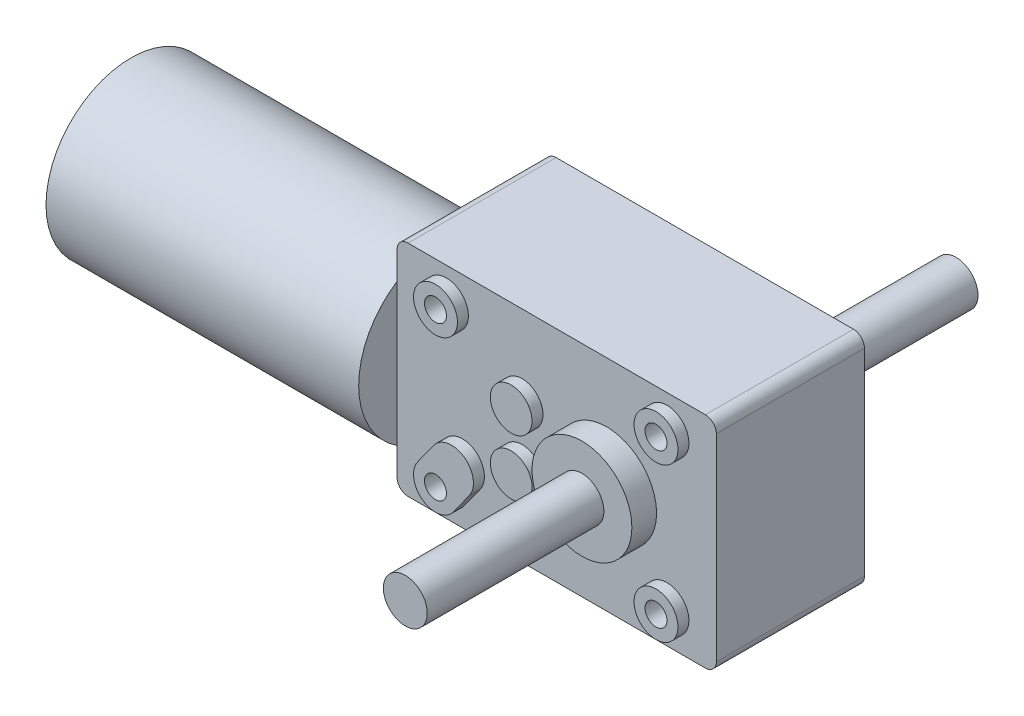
ISO-10303-21;
HEADER;
FILE_DESCRIPTION(('STEP AP214'),'2;1');
FILE_NAME('part.step','',(''),(''),'','','');
FILE_SCHEMA(('AUTOMOTIVE_DESIGN { 1 0 10303 214 1 1 1 1 }'));
ENDSEC;
DATA;
#1=APPLICATION_CONTEXT('core data for automotive mechanical design processes');
#2=APPLICATION_PROTOCOL_DEFINITION('international standard','automotive_design',2000,#1);
#3=PRODUCT_CONTEXT('',#1,'mechanical');
#4=PRODUCT('Part','Part','',(#3));
#5=PRODUCT_RELATED_PRODUCT_CATEGORY('part','',(#4));
#6=PRODUCT_DEFINITION_FORMATION('','',#4);
#7=PRODUCT_DEFINITION_CONTEXT('part definition',#1,'design');
#8=PRODUCT_DEFINITION('design','',#6,#7);
#9=PRODUCT_DEFINITION_SHAPE('','',#8);
#10=(LENGTH_UNIT() NAMED_UNIT(*) SI_UNIT(.MILLI.,.METRE.));
#11=(NAMED_UNIT(*) PLANE_ANGLE_UNIT() SI_UNIT($,.RADIAN.));
#12=(NAMED_UNIT(*) SI_UNIT($,.STERADIAN.) SOLID_ANGLE_UNIT());
#13=UNCERTAINTY_MEASURE_WITH_UNIT(LENGTH_MEASURE(1.E-05),#10,'distance_accuracy_value','');
#14=(GEOMETRIC_REPRESENTATION_CONTEXT(3) GLOBAL_UNCERTAINTY_ASSIGNED_CONTEXT((#13)) GLOBAL_UNIT_ASSIGNED_CONTEXT((#10,
#11,#12)) REPRESENTATION_CONTEXT('',''));
#15=CARTESIAN_POINT('',(0.,0.,0.));
#16=DIRECTION('',(0.,0.,1.));
#17=DIRECTION('',(1.,0.,0.));
#18=AXIS2_PLACEMENT_3D('',#15,#16,#17);
#19=CARTESIAN_POINT('',(2.,2.,13.5));
#20=DIRECTION('',(0.,0.,-1.));
#21=DIRECTION('',(-1.,0.,0.));
#22=AXIS2_PLACEMENT_3D('',#19,#20,#21);
#23=PLANE('',#22);
#24=CARTESIAN_POINT('',(38.2,20.,13.5));
#25=DIRECTION('',(0.,0.,-1.));
#26=DIRECTION('',(-1.,0.,0.));
#27=AXIS2_PLACEMENT_3D('',#24,#25,#26);
#28=CIRCLE('',#27,9.1);
#29=CARTESIAN_POINT('',(29.1,20.,13.5));
#30=VERTEX_POINT('',#29);
#31=EDGE_CURVE('E40',#30,#30,#28,.F.);
#32=ORIENTED_EDGE('',*,*,#31,.F.);
#33=EDGE_LOOP('',(#32));
#34=FACE_BOUND('',#33,.T.);
#35=CARTESIAN_POINT('',(2.,2.,13.5));
#36=DIRECTION('',(0.,0.,1.));
#37=DIRECTION('',(-1.,0.,0.));
#38=AXIS2_PLACEMENT_3D('',#35,#36,#37);
#39=CIRCLE('',#38,2.);
#40=CARTESIAN_POINT('',(0.,2.00000000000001,13.5));
#41=VERTEX_POINT('',#40);
#42=CARTESIAN_POINT('',(2.00000000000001,0.,13.5));
#43=VERTEX_POINT('',#42);
#44=EDGE_CURVE('E384',#41,#43,#39,.T.);
#45=ORIENTED_EDGE('',*,*,#44,.T.);
#46=DIRECTION('',(1.,0.,0.));
#47=VECTOR('',#46,1.);
#48=CARTESIAN_POINT('',(2.00000000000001,0.,13.5));
#49=LINE('',#48,#47);
#50=CARTESIAN_POINT('',(56.2,0.,13.5));
#51=VERTEX_POINT('',#50);
#52=EDGE_CURVE('E386',#43,#51,#49,.T.);
#53=ORIENTED_EDGE('',*,*,#52,.T.);
#54=CARTESIAN_POINT('',(56.2,2.,13.5));
#55=DIRECTION('',(0.,0.,1.));
#56=DIRECTION('',(1.,0.,0.));
#57=AXIS2_PLACEMENT_3D('',#54,#55,#56);
#58=CIRCLE('',#57,2.);
#59=CARTESIAN_POINT('',(58.2,2.,13.5));
#60=VERTEX_POINT('',#59);
#61=EDGE_CURVE('E388',#51,#60,#58,.T.);
#62=ORIENTED_EDGE('',*,*,#61,.T.);
#63=DIRECTION('',(0.,1.,0.));
#64=VECTOR('',#63,1.);
#65=CARTESIAN_POINT('',(58.2,2.00000000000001,13.5));
#66=LINE('',#65,#64);
#67=CARTESIAN_POINT('',(58.2,38.,13.5));
#68=VERTEX_POINT('',#67);
#69=EDGE_CURVE('E390',#60,#68,#66,.T.);
#70=ORIENTED_EDGE('',*,*,#69,.T.);
#71=CARTESIAN_POINT('',(56.2,38.,13.5));
#72=DIRECTION('',(0.,0.,1.));
#73=DIRECTION('',(-1.,0.,0.));
#74=AXIS2_PLACEMENT_3D('',#71,#72,#73);
#75=CIRCLE('',#74,2.);
#76=CARTESIAN_POINT('',(56.2,40.,13.5));
#77=VERTEX_POINT('',#76);
#78=EDGE_CURVE('E392',#68,#77,#75,.T.);
#79=ORIENTED_EDGE('',*,*,#78,.T.);
#80=DIRECTION('',(-1.,0.,0.));
#81=VECTOR('',#80,1.);
#82=CARTESIAN_POINT('',(2.00000000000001,40.,13.5));
#83=LINE('',#82,#81);
#84=CARTESIAN_POINT('',(2.00000000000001,40.,13.5));
#85=VERTEX_POINT('',#84);
#86=EDGE_CURVE('E394',#77,#85,#83,.T.);
#87=ORIENTED_EDGE('',*,*,#86,.T.);
#88=CARTESIAN_POINT('',(2.,38.,13.5));
#89=DIRECTION('',(0.,0.,1.));
#90=DIRECTION('',(-1.,0.,0.));
#91=AXIS2_PLACEMENT_3D('',#88,#89,#90);
#92=CIRCLE('',#91,2.);
#93=CARTESIAN_POINT('',(0.,38.,13.5));
#94=VERTEX_POINT('',#93);
#95=EDGE_CURVE('E172',#85,#94,#92,.T.);
#96=ORIENTED_EDGE('',*,*,#95,.T.);
#97=DIRECTION('',(0.,-1.,0.));
#98=VECTOR('',#97,1.);
#99=CARTESIAN_POINT('',(0.,2.00000000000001,13.5));
#100=LINE('',#99,#98);
#101=CARTESIAN_POINT('',(0.,32.9614813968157,13.5));
#102=VERTEX_POINT('',#101);
#103=EDGE_CURVE('E163',#94,#102,#100,.T.);
#104=ORIENTED_EDGE('',*,*,#103,.T.);
#105=CARTESIAN_POINT('',(0.,7.03851860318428,13.5));
#106=VERTEX_POINT('',#105);
#107=EDGE_CURVE('E158',#102,#106,#100,.T.);
#108=ORIENTED_EDGE('',*,*,#107,.T.);
#109=EDGE_CURVE('E161',#106,#41,#100,.T.);
#110=ORIENTED_EDGE('',*,*,#109,.T.);
#111=EDGE_LOOP('',(#45,#53,#62,#70,#79,#87,#96,#104,#108,#110));
#112=FACE_BOUND('',#111,.T.);
#113=CARTESIAN_POINT('',(9.,34.,13.5));
#114=DIRECTION('',(0.,0.,-1.));
#115=DIRECTION('',(-1.,0.,0.));
#116=AXIS2_PLACEMENT_3D('',#113,#114,#115);
#117=CIRCLE('',#116,4.);
#118=CARTESIAN_POINT('',(4.99999999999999,34.,13.5));
#119=VERTEX_POINT('',#118);
#120=EDGE_CURVE('E412',#119,#119,#117,.F.);
#121=ORIENTED_EDGE('',*,*,#120,.F.);
#122=EDGE_LOOP('',(#121));
#123=FACE_BOUND('',#122,.T.);
#124=CARTESIAN_POINT('',(49.2,34.,13.5));
#125=DIRECTION('',(0.,0.,-1.));
#126=DIRECTION('',(-1.,0.,0.));
#127=AXIS2_PLACEMENT_3D('',#124,#125,#126);
#128=CIRCLE('',#127,4.00000000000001);
#129=CARTESIAN_POINT('',(45.2,34.,13.5));
#130=VERTEX_POINT('',#129);
#131=EDGE_CURVE('E415',#130,#130,#128,.F.);
#132=ORIENTED_EDGE('',*,*,#131,.F.);
#133=EDGE_LOOP('',(#132));
#134=FACE_BOUND('',#133,.T.);
#135=CARTESIAN_POINT('',(49.2,6.,13.5));
#136=DIRECTION('',(0.,0.,-1.));
#137=DIRECTION('',(-1.,0.,0.));
#138=AXIS2_PLACEMENT_3D('',#135,#136,#137);
#139=CIRCLE('',#138,4.00000000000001);
#140=CARTESIAN_POINT('',(45.2,6.,13.5));
#141=VERTEX_POINT('',#140);
#142=EDGE_CURVE('E418',#141,#141,#139,.F.);
#143=ORIENTED_EDGE('',*,*,#142,.F.);
#144=EDGE_LOOP('',(#143));
#145=FACE_BOUND('',#144,.T.);
#146=CARTESIAN_POINT('',(22.8,25.2,13.5));
#147=DIRECTION('',(0.,0.,-1.));
#148=DIRECTION('',(-1.,0.,0.));
#149=AXIS2_PLACEMENT_3D('',#146,#147,#148);
#150=CIRCLE('',#149,3.8);
#151=CARTESIAN_POINT('',(19.,25.2,13.5));
#152=VERTEX_POINT('',#151);
#153=EDGE_CURVE('E421',#152,#152,#150,.F.);
#154=ORIENTED_EDGE('',*,*,#153,.F.);
#155=EDGE_LOOP('',(#154));
#156=FACE_BOUND('',#155,.T.);
#157=CARTESIAN_POINT('',(22.8,14.8,13.5));
#158=DIRECTION('',(0.,0.,-1.));
#159=DIRECTION('',(-1.,0.,0.));
#160=AXIS2_PLACEMENT_3D('',#157,#158,#159);
#161=CIRCLE('',#160,3.8);
#162=CARTESIAN_POINT('',(19.,14.8,13.5));
#163=VERTEX_POINT('',#162);
#164=EDGE_CURVE('E423',#163,#163,#161,.F.);
#165=ORIENTED_EDGE('',*,*,#164,.F.);
#166=EDGE_LOOP('',(#165));
#167=FACE_BOUND('',#166,.T.);
#168=CARTESIAN_POINT('',(9.,6.,13.5));
#169=DIRECTION('',(0.,0.,1.));
#170=DIRECTION('',(1.,0.,0.));
#171=AXIS2_PLACEMENT_3D('',#168,#169,#170);
#172=CIRCLE('',#171,4.);
#173=CARTESIAN_POINT('',(5.75193851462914,8.3345441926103,13.5));
#174=VERTEX_POINT('',#173);
#175=CARTESIAN_POINT('',(12.2480614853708,3.6654558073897,13.5));
#176=VERTEX_POINT('',#175);
#177=EDGE_CURVE('E336',#174,#176,#172,.T.);
#178=ORIENTED_EDGE('',*,*,#177,.F.);
#179=DIRECTION('',(-0.583636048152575,-0.812015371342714,0.));
#180=VECTOR('',#179,1.);
#181=CARTESIAN_POINT('',(5.75193851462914,8.3345441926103,13.5));
#182=LINE('',#181,#180);
#183=CARTESIAN_POINT('',(8.67011875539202,12.3946210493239,13.5));
#184=VERTEX_POINT('',#183);
#185=EDGE_CURVE('E341',#184,#174,#182,.T.);
#186=ORIENTED_EDGE('',*,*,#185,.F.);
#187=CARTESIAN_POINT('',(11.9181802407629,10.0600768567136,13.5));
#188=DIRECTION('',(0.,0.,1.));
#189=DIRECTION('',(1.,0.,0.));
#190=AXIS2_PLACEMENT_3D('',#187,#188,#189);
#191=CIRCLE('',#190,4.);
#192=CARTESIAN_POINT('',(15.1662417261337,7.72553266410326,13.5));
#193=VERTEX_POINT('',#192);
#194=EDGE_CURVE('E353',#193,#184,#191,.T.);
#195=ORIENTED_EDGE('',*,*,#194,.F.);
#196=DIRECTION('',(0.583636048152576,0.812015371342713,0.));
#197=VECTOR('',#196,1.);
#198=CARTESIAN_POINT('',(12.2480614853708,3.6654558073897,13.5));
#199=LINE('',#198,#197);
#200=EDGE_CURVE('E350',#176,#193,#199,.T.);
#201=ORIENTED_EDGE('',*,*,#200,.F.);
#202=EDGE_LOOP('',(#178,#186,#195,#201));
#203=FACE_BOUND('',#202,.T.);
#204=ADVANCED_FACE('F36',(#34,#112,#123,#134,#145,#156,#167,#203),#23,.F.);
#205=CARTESIAN_POINT('',(2.,2.,13.5));
#206=DIRECTION('',(0.,0.,-1.));
#207=DIRECTION('',(-1.,0.,0.));
#208=AXIS2_PLACEMENT_3D('',#205,#206,#207);
#209=CYLINDRICAL_SURFACE('',#208,2.);
#210=DIRECTION('',(0.,0.,-1.));
#211=VECTOR('',#210,1.);
#212=CARTESIAN_POINT('',(0.,2.00000000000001,13.5));
#213=LINE('',#212,#211);
#214=CARTESIAN_POINT('',(0.,2.00000000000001,-13.5));
#215=VERTEX_POINT('',#214);
#216=EDGE_CURVE('E170',#41,#215,#213,.T.);
#217=ORIENTED_EDGE('',*,*,#216,.T.);
#218=CARTESIAN_POINT('',(2.,2.,-13.5));
#219=DIRECTION('',(0.,0.,1.));
#220=DIRECTION('',(-1.,0.,0.));
#221=AXIS2_PLACEMENT_3D('',#218,#219,#220);
#222=CIRCLE('',#221,2.);
#223=CARTESIAN_POINT('',(2.00000000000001,0.,-13.5));
#224=VERTEX_POINT('',#223);
#225=EDGE_CURVE('E278',#215,#224,#222,.T.);
#226=ORIENTED_EDGE('',*,*,#225,.T.);
#227=DIRECTION('',(0.,0.,-1.));
#228=VECTOR('',#227,1.);
#229=CARTESIAN_POINT('',(2.00000000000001,0.,13.5));
#230=LINE('',#229,#228);
#231=EDGE_CURVE('E410',#43,#224,#230,.T.);
#232=ORIENTED_EDGE('',*,*,#231,.F.);
#233=ORIENTED_EDGE('',*,*,#44,.F.);
#234=EDGE_LOOP('',(#217,#226,#232,#233));
#235=FACE_BOUND('',#234,.T.);
#236=ADVANCED_FACE('F38',(#235),#209,.T.);
#237=CARTESIAN_POINT('',(2.00000000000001,0.,13.5));
#238=DIRECTION('',(0.,1.,0.));
#239=DIRECTION('',(0.,0.,1.));
#240=AXIS2_PLACEMENT_3D('',#237,#238,#239);
#241=PLANE('',#240);
#242=ORIENTED_EDGE('',*,*,#231,.T.);
#243=DIRECTION('',(1.,0.,0.));
#244=VECTOR('',#243,1.);
#245=CARTESIAN_POINT('',(2.00000000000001,0.,-13.5));
#246=LINE('',#245,#244);
#247=CARTESIAN_POINT('',(56.2,0.,-13.5));
#248=VERTEX_POINT('',#247);
#249=EDGE_CURVE('E300',#224,#248,#246,.T.);
#250=ORIENTED_EDGE('',*,*,#249,.T.);
#251=DIRECTION('',(0.,0.,-1.));
#252=VECTOR('',#251,1.);
#253=CARTESIAN_POINT('',(56.2,0.,13.5));
#254=LINE('',#253,#252);
#255=EDGE_CURVE('E408',#51,#248,#254,.T.);
#256=ORIENTED_EDGE('',*,*,#255,.F.);
#257=ORIENTED_EDGE('',*,*,#52,.F.);
#258=EDGE_LOOP('',(#242,#250,#256,#257));
#259=FACE_BOUND('',#258,.T.);
#260=ADVANCED_FACE('F437',(#259),#241,.F.);
#261=CARTESIAN_POINT('',(56.2,2.,13.5));
#262=DIRECTION('',(0.,0.,-1.));
#263=DIRECTION('',(-1.,0.,0.));
#264=AXIS2_PLACEMENT_3D('',#261,#262,#263);
#265=CYLINDRICAL_SURFACE('',#264,2.);
#266=ORIENTED_EDGE('',*,*,#255,.T.);
#267=CARTESIAN_POINT('',(56.2,2.,-13.5));
#268=DIRECTION('',(0.,0.,1.));
#269=DIRECTION('',(1.,0.,0.));
#270=AXIS2_PLACEMENT_3D('',#267,#268,#269);
#271=CIRCLE('',#270,2.);
#272=CARTESIAN_POINT('',(58.2,2.,-13.5));
#273=VERTEX_POINT('',#272);
#274=EDGE_CURVE('E297',#248,#273,#271,.T.);
#275=ORIENTED_EDGE('',*,*,#274,.T.);
#276=DIRECTION('',(0.,0.,-1.));
#277=VECTOR('',#276,1.);
#278=CARTESIAN_POINT('',(58.2,2.,13.5));
#279=LINE('',#278,#277);
#280=EDGE_CURVE('E406',#60,#273,#279,.T.);
#281=ORIENTED_EDGE('',*,*,#280,.F.);
#282=ORIENTED_EDGE('',*,*,#61,.F.);
#283=EDGE_LOOP('',(#266,#275,#281,#282));
#284=FACE_BOUND('',#283,.T.);
#285=ADVANCED_FACE('F460',(#284),#265,.T.);
#286=CARTESIAN_POINT('',(58.2,2.00000000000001,13.5));
#287=DIRECTION('',(-1.,0.,0.));
#288=DIRECTION('',(0.,0.,1.));
#289=AXIS2_PLACEMENT_3D('',#286,#287,#288);
#290=PLANE('',#289);
#291=ORIENTED_EDGE('',*,*,#280,.T.);
#292=DIRECTION('',(0.,1.,0.));
#293=VECTOR('',#292,1.);
#294=CARTESIAN_POINT('',(58.2,2.00000000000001,-13.5));
#295=LINE('',#294,#293);
#296=CARTESIAN_POINT('',(58.2,38.,-13.5));
#297=VERTEX_POINT('',#296);
#298=EDGE_CURVE('E294',#273,#297,#295,.T.);
#299=ORIENTED_EDGE('',*,*,#298,.T.);
#300=DIRECTION('',(0.,0.,-1.));
#301=VECTOR('',#300,1.);
#302=CARTESIAN_POINT('',(58.2,38.,13.5));
#303=LINE('',#302,#301);
#304=EDGE_CURVE('E404',#68,#297,#303,.T.);
#305=ORIENTED_EDGE('',*,*,#304,.F.);
#306=ORIENTED_EDGE('',*,*,#69,.F.);
#307=EDGE_LOOP('',(#291,#299,#305,#306));
#308=FACE_BOUND('',#307,.T.);
#309=ADVANCED_FACE('F456',(#308),#290,.F.);
#310=CARTESIAN_POINT('',(56.2,38.,13.5));
#311=DIRECTION('',(0.,0.,-1.));
#312=DIRECTION('',(-1.,0.,0.));
#313=AXIS2_PLACEMENT_3D('',#310,#311,#312);
#314=CYLINDRICAL_SURFACE('',#313,2.);
#315=ORIENTED_EDGE('',*,*,#304,.T.);
#316=CARTESIAN_POINT('',(56.2,38.,-13.5));
#317=DIRECTION('',(0.,0.,1.));
#318=DIRECTION('',(-1.,0.,0.));
#319=AXIS2_PLACEMENT_3D('',#316,#317,#318);
#320=CIRCLE('',#319,2.);
#321=CARTESIAN_POINT('',(56.2,40.,-13.5));
#322=VERTEX_POINT('',#321);
#323=EDGE_CURVE('E291',#297,#322,#320,.T.);
#324=ORIENTED_EDGE('',*,*,#323,.T.);
#325=DIRECTION('',(0.,0.,-1.));
#326=VECTOR('',#325,1.);
#327=CARTESIAN_POINT('',(56.2,40.,13.5));
#328=LINE('',#327,#326);
#329=EDGE_CURVE('E402',#77,#322,#328,.T.);
#330=ORIENTED_EDGE('',*,*,#329,.F.);
#331=ORIENTED_EDGE('',*,*,#78,.F.);
#332=EDGE_LOOP('',(#315,#324,#330,#331));
#333=FACE_BOUND('',#332,.T.);
#334=ADVANCED_FACE('F452',(#333),#314,.T.);
#335=CARTESIAN_POINT('',(2.00000000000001,40.,13.5));
#336=DIRECTION('',(0.,-1.,0.));
#337=DIRECTION('',(0.,0.,-1.));
#338=AXIS2_PLACEMENT_3D('',#335,#336,#337);
#339=PLANE('',#338);
#340=ORIENTED_EDGE('',*,*,#329,.T.);
#341=DIRECTION('',(-1.,0.,0.));
#342=VECTOR('',#341,1.);
#343=CARTESIAN_POINT('',(2.00000000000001,40.,-13.5));
#344=LINE('',#343,#342);
#345=CARTESIAN_POINT('',(2.00000000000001,40.,-13.5));
#346=VERTEX_POINT('',#345);
#347=EDGE_CURVE('E288',#322,#346,#344,.T.);
#348=ORIENTED_EDGE('',*,*,#347,.T.);
#349=DIRECTION('',(0.,0.,-1.));
#350=VECTOR('',#349,1.);
#351=CARTESIAN_POINT('',(2.00000000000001,40.,13.5));
#352=LINE('',#351,#350);
#353=EDGE_CURVE('E400',#85,#346,#352,.T.);
#354=ORIENTED_EDGE('',*,*,#353,.F.);
#355=ORIENTED_EDGE('',*,*,#86,.F.);
#356=EDGE_LOOP('',(#340,#348,#354,#355));
#357=FACE_BOUND('',#356,.T.);
#358=ADVANCED_FACE('F448',(#357),#339,.F.);
#359=CARTESIAN_POINT('',(2.,38.,13.5));
#360=DIRECTION('',(0.,0.,-1.));
#361=DIRECTION('',(-1.,0.,0.));
#362=AXIS2_PLACEMENT_3D('',#359,#360,#361);
#363=CYLINDRICAL_SURFACE('',#362,2.);
#364=ORIENTED_EDGE('',*,*,#353,.T.);
#365=CARTESIAN_POINT('',(2.,38.,-13.5));
#366=DIRECTION('',(0.,0.,1.));
#367=DIRECTION('',(-1.,0.,0.));
#368=AXIS2_PLACEMENT_3D('',#365,#366,#367);
#369=CIRCLE('',#368,2.);
#370=CARTESIAN_POINT('',(0.,38.,-13.5));
#371=VERTEX_POINT('',#370);
#372=EDGE_CURVE('E285',#346,#371,#369,.T.);
#373=ORIENTED_EDGE('',*,*,#372,.T.);
#374=DIRECTION('',(0.,0.,-1.));
#375=VECTOR('',#374,1.);
#376=CARTESIAN_POINT('',(0.,38.,13.5));
#377=LINE('',#376,#375);
#378=EDGE_CURVE('E398',#94,#371,#377,.T.);
#379=ORIENTED_EDGE('',*,*,#378,.F.);
#380=ORIENTED_EDGE('',*,*,#95,.F.);
#381=EDGE_LOOP('',(#364,#373,#379,#380));
#382=FACE_BOUND('',#381,.T.);
#383=ADVANCED_FACE('F445',(#382),#363,.T.);
#384=CARTESIAN_POINT('',(0.,2.00000000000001,13.5));
#385=DIRECTION('',(1.,0.,0.));
#386=DIRECTION('',(0.,0.,-1.));
#387=AXIS2_PLACEMENT_3D('',#384,#385,#386);
#388=PLANE('',#387);
#389=CARTESIAN_POINT('',(0.,20.,5.));
#390=DIRECTION('',(-1.,0.,0.));
#391=DIRECTION('',(0.,0.,1.));
#392=AXIS2_PLACEMENT_3D('',#389,#390,#391);
#393=CIRCLE('',#392,15.5);
#394=EDGE_CURVE('E53',#102,#106,#393,.T.);
#395=ORIENTED_EDGE('',*,*,#394,.F.);
#396=ORIENTED_EDGE('',*,*,#103,.F.);
#397=ORIENTED_EDGE('',*,*,#378,.T.);
#398=DIRECTION('',(0.,-1.,0.));
#399=VECTOR('',#398,1.);
#400=CARTESIAN_POINT('',(0.,2.00000000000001,-13.5));
#401=LINE('',#400,#399);
#402=EDGE_CURVE('E283',#371,#215,#401,.T.);
#403=ORIENTED_EDGE('',*,*,#402,.T.);
#404=ORIENTED_EDGE('',*,*,#216,.F.);
#405=ORIENTED_EDGE('',*,*,#109,.F.);
#406=EDGE_LOOP('',(#395,#396,#397,#403,#404,#405));
#407=FACE_BOUND('',#406,.T.);
#408=ADVANCED_FACE('F168',(#407),#388,.F.);
#409=CARTESIAN_POINT('',(9.,34.,15.5));
#410=DIRECTION('',(0.,0.,-1.));
#411=DIRECTION('',(-1.,0.,0.));
#412=AXIS2_PLACEMENT_3D('',#409,#410,#411);
#413=CYLINDRICAL_SURFACE('',#412,4.);
#414=CARTESIAN_POINT('',(9.,34.,15.5));
#415=DIRECTION('',(0.,0.,1.));
#416=DIRECTION('',(1.,0.,0.));
#417=AXIS2_PLACEMENT_3D('',#414,#415,#416);
#418=CIRCLE('',#417,4.);
#419=CARTESIAN_POINT('',(13.,34.,15.5));
#420=VERTEX_POINT('',#419);
#421=EDGE_CURVE('E381',#420,#420,#418,.T.);
#422=ORIENTED_EDGE('',*,*,#421,.F.);
#423=EDGE_LOOP('',(#422));
#424=FACE_BOUND('',#423,.T.);
#425=ORIENTED_EDGE('',*,*,#120,.T.);
#426=EDGE_LOOP('',(#425));
#427=FACE_BOUND('',#426,.T.);
#428=ADVANCED_FACE('F441',(#424,#427),#413,.T.);
#429=CARTESIAN_POINT('',(9.,34.,15.5));
#430=DIRECTION('',(0.,0.,1.));
#431=DIRECTION('',(1.,0.,0.));
#432=AXIS2_PLACEMENT_3D('',#429,#430,#431);
#433=PLANE('',#432);
#434=CARTESIAN_POINT('',(9.,34.,15.5));
#435=DIRECTION('',(0.,0.,1.));
#436=DIRECTION('',(1.,0.,0.));
#437=AXIS2_PLACEMENT_3D('',#434,#435,#436);
#438=CIRCLE('',#437,2.);
#439=CARTESIAN_POINT('',(11.,34.,15.5));
#440=VERTEX_POINT('',#439);
#441=EDGE_CURVE('E307',#440,#440,#438,.T.);
#442=ORIENTED_EDGE('',*,*,#441,.F.);
#443=EDGE_LOOP('',(#442));
#444=FACE_BOUND('',#443,.T.);
#445=ORIENTED_EDGE('',*,*,#421,.T.);
#446=EDGE_LOOP('',(#445));
#447=FACE_BOUND('',#446,.T.);
#448=ADVANCED_FACE('F600',(#444,#447),#433,.T.);
#449=CARTESIAN_POINT('',(49.2,34.,15.5));
#450=DIRECTION('',(0.,0.,-1.));
#451=DIRECTION('',(-1.,0.,0.));
#452=AXIS2_PLACEMENT_3D('',#449,#450,#451);
#453=CYLINDRICAL_SURFACE('',#452,4.00000000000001);
#454=CARTESIAN_POINT('',(49.2,34.,15.5));
#455=DIRECTION('',(0.,0.,1.));
#456=DIRECTION('',(1.,0.,0.));
#457=AXIS2_PLACEMENT_3D('',#454,#455,#456);
#458=CIRCLE('',#457,4.00000000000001);
#459=CARTESIAN_POINT('',(53.2,34.,15.5));
#460=VERTEX_POINT('',#459);
#461=EDGE_CURVE('E378',#460,#460,#458,.T.);
#462=ORIENTED_EDGE('',*,*,#461,.F.);
#463=EDGE_LOOP('',(#462));
#464=FACE_BOUND('',#463,.T.);
#465=ORIENTED_EDGE('',*,*,#131,.T.);
#466=EDGE_LOOP('',(#465));
#467=FACE_BOUND('',#466,.T.);
#468=ADVANCED_FACE('F597',(#464,#467),#453,.T.);
#469=CARTESIAN_POINT('',(49.2,34.,15.5));
#470=DIRECTION('',(0.,0.,1.));
#471=DIRECTION('',(1.,0.,0.));
#472=AXIS2_PLACEMENT_3D('',#469,#470,#471);
#473=PLANE('',#472);
#474=CARTESIAN_POINT('',(49.2,34.,15.5));
#475=DIRECTION('',(0.,0.,1.));
#476=DIRECTION('',(1.,0.,0.));
#477=AXIS2_PLACEMENT_3D('',#474,#475,#476);
#478=CIRCLE('',#477,2.);
#479=CARTESIAN_POINT('',(51.2,34.,15.5));
#480=VERTEX_POINT('',#479);
#481=EDGE_CURVE('E308',#480,#480,#478,.T.);
#482=ORIENTED_EDGE('',*,*,#481,.F.);
#483=EDGE_LOOP('',(#482));
#484=FACE_BOUND('',#483,.T.);
#485=ORIENTED_EDGE('',*,*,#461,.T.);
#486=EDGE_LOOP('',(#485));
#487=FACE_BOUND('',#486,.T.);
#488=ADVANCED_FACE('F593',(#484,#487),#473,.T.);
#489=CARTESIAN_POINT('',(49.2,6.,15.5));
#490=DIRECTION('',(0.,0.,-1.));
#491=DIRECTION('',(-1.,0.,0.));
#492=AXIS2_PLACEMENT_3D('',#489,#490,#491);
#493=CYLINDRICAL_SURFACE('',#492,4.00000000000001);
#494=CARTESIAN_POINT('',(49.2,6.,15.5));
#495=DIRECTION('',(0.,0.,1.));
#496=DIRECTION('',(1.,0.,0.));
#497=AXIS2_PLACEMENT_3D('',#494,#495,#496);
#498=CIRCLE('',#497,4.00000000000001);
#499=CARTESIAN_POINT('',(53.2,6.,15.5));
#500=VERTEX_POINT('',#499);
#501=EDGE_CURVE('E375',#500,#500,#498,.T.);
#502=ORIENTED_EDGE('',*,*,#501,.F.);
#503=EDGE_LOOP('',(#502));
#504=FACE_BOUND('',#503,.T.);
#505=ORIENTED_EDGE('',*,*,#142,.T.);
#506=EDGE_LOOP('',(#505));
#507=FACE_BOUND('',#506,.T.);
#508=ADVANCED_FACE('F589',(#504,#507),#493,.T.);
#509=CARTESIAN_POINT('',(49.2,6.,15.5));
#510=DIRECTION('',(0.,0.,1.));
#511=DIRECTION('',(1.,0.,0.));
#512=AXIS2_PLACEMENT_3D('',#509,#510,#511);
#513=PLANE('',#512);
#514=CARTESIAN_POINT('',(49.2,6.,15.5));
#515=DIRECTION('',(0.,0.,1.));
#516=DIRECTION('',(1.,0.,0.));
#517=AXIS2_PLACEMENT_3D('',#514,#515,#516);
#518=CIRCLE('',#517,2.);
#519=CARTESIAN_POINT('',(51.2,6.,15.5));
#520=VERTEX_POINT('',#519);
#521=EDGE_CURVE('E314',#520,#520,#518,.T.);
#522=ORIENTED_EDGE('',*,*,#521,.F.);
#523=EDGE_LOOP('',(#522));
#524=FACE_BOUND('',#523,.T.);
#525=ORIENTED_EDGE('',*,*,#501,.T.);
#526=EDGE_LOOP('',(#525));
#527=FACE_BOUND('',#526,.T.);
#528=ADVANCED_FACE('F585',(#524,#527),#513,.T.);
#529=CARTESIAN_POINT('',(22.8,25.2,15.5));
#530=DIRECTION('',(0.,0.,-1.));
#531=DIRECTION('',(-1.,0.,0.));
#532=AXIS2_PLACEMENT_3D('',#529,#530,#531);
#533=CYLINDRICAL_SURFACE('',#532,3.8);
#534=CARTESIAN_POINT('',(22.8,25.2,15.5));
#535=DIRECTION('',(0.,0.,1.));
#536=DIRECTION('',(1.,0.,0.));
#537=AXIS2_PLACEMENT_3D('',#534,#535,#536);
#538=CIRCLE('',#537,3.8);
#539=CARTESIAN_POINT('',(26.6,25.2,15.5));
#540=VERTEX_POINT('',#539);
#541=EDGE_CURVE('E372',#540,#540,#538,.T.);
#542=ORIENTED_EDGE('',*,*,#541,.F.);
#543=EDGE_LOOP('',(#542));
#544=FACE_BOUND('',#543,.T.);
#545=ORIENTED_EDGE('',*,*,#153,.T.);
#546=EDGE_LOOP('',(#545));
#547=FACE_BOUND('',#546,.T.);
#548=ADVANCED_FACE('F581',(#544,#547),#533,.T.);
#549=CARTESIAN_POINT('',(22.8,25.2,15.5));
#550=DIRECTION('',(0.,0.,1.));
#551=DIRECTION('',(1.,0.,0.));
#552=AXIS2_PLACEMENT_3D('',#549,#550,#551);
#553=PLANE('',#552);
#554=ORIENTED_EDGE('',*,*,#541,.T.);
#555=EDGE_LOOP('',(#554));
#556=FACE_BOUND('',#555,.T.);
#557=ADVANCED_FACE('F577',(#556),#553,.T.);
#558=CARTESIAN_POINT('',(22.8,14.8,15.5));
#559=DIRECTION('',(0.,0.,-1.));
#560=DIRECTION('',(-1.,0.,0.));
#561=AXIS2_PLACEMENT_3D('',#558,#559,#560);
#562=CYLINDRICAL_SURFACE('',#561,3.8);
#563=CARTESIAN_POINT('',(22.8,14.8,15.5));
#564=DIRECTION('',(0.,0.,1.));
#565=DIRECTION('',(1.,0.,0.));
#566=AXIS2_PLACEMENT_3D('',#563,#564,#565);
#567=CIRCLE('',#566,3.8);
#568=CARTESIAN_POINT('',(26.6,14.8,15.5));
#569=VERTEX_POINT('',#568);
#570=EDGE_CURVE('E369',#569,#569,#567,.T.);
#571=ORIENTED_EDGE('',*,*,#570,.F.);
#572=EDGE_LOOP('',(#571));
#573=FACE_BOUND('',#572,.T.);
#574=ORIENTED_EDGE('',*,*,#164,.T.);
#575=EDGE_LOOP('',(#574));
#576=FACE_BOUND('',#575,.T.);
#577=ADVANCED_FACE('F573',(#573,#576),#562,.T.);
#578=CARTESIAN_POINT('',(22.8,14.8,15.5));
#579=DIRECTION('',(0.,0.,1.));
#580=DIRECTION('',(1.,0.,0.));
#581=AXIS2_PLACEMENT_3D('',#578,#579,#580);
#582=PLANE('',#581);
#583=ORIENTED_EDGE('',*,*,#570,.T.);
#584=EDGE_LOOP('',(#583));
#585=FACE_BOUND('',#584,.T.);
#586=ADVANCED_FACE('F569',(#585),#582,.T.);
#587=CARTESIAN_POINT('',(9.,6.,15.5));
#588=DIRECTION('',(0.,0.,-1.));
#589=DIRECTION('',(-1.,0.,0.));
#590=AXIS2_PLACEMENT_3D('',#587,#588,#589);
#591=CYLINDRICAL_SURFACE('',#590,4.);
#592=ORIENTED_EDGE('',*,*,#177,.T.);
#593=DIRECTION('',(0.,0.,-1.));
#594=VECTOR('',#593,1.);
#595=CARTESIAN_POINT('',(12.2480614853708,3.6654558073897,15.5));
#596=LINE('',#595,#594);
#597=CARTESIAN_POINT('',(12.2480614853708,3.6654558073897,15.5));
#598=VERTEX_POINT('',#597);
#599=EDGE_CURVE('E366',#598,#176,#596,.T.);
#600=ORIENTED_EDGE('',*,*,#599,.F.);
#601=CARTESIAN_POINT('',(9.,6.,15.5));
#602=DIRECTION('',(0.,0.,1.));
#603=DIRECTION('',(1.,0.,0.));
#604=AXIS2_PLACEMENT_3D('',#601,#602,#603);
#605=CIRCLE('',#604,4.);
#606=CARTESIAN_POINT('',(5.75193851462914,8.3345441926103,15.5));
#607=VERTEX_POINT('',#606);
#608=EDGE_CURVE('E337',#607,#598,#605,.T.);
#609=ORIENTED_EDGE('',*,*,#608,.F.);
#610=DIRECTION('',(0.,0.,-1.));
#611=VECTOR('',#610,1.);
#612=CARTESIAN_POINT('',(5.75193851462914,8.3345441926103,15.5));
#613=LINE('',#612,#611);
#614=EDGE_CURVE('E347',#607,#174,#613,.T.);
#615=ORIENTED_EDGE('',*,*,#614,.T.);
#616=EDGE_LOOP('',(#592,#600,#609,#615));
#617=FACE_BOUND('',#616,.T.);
#618=ADVANCED_FACE('F565',(#617),#591,.T.);
#619=CARTESIAN_POINT('',(12.2480614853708,3.6654558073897,15.5));
#620=DIRECTION('',(-0.812015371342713,0.583636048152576,0.));
#621=DIRECTION('',(-0.583636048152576,-0.812015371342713,0.));
#622=AXIS2_PLACEMENT_3D('',#619,#620,#621);
#623=PLANE('',#622);
#624=ORIENTED_EDGE('',*,*,#200,.T.);
#625=DIRECTION('',(0.,0.,-1.));
#626=VECTOR('',#625,1.);
#627=CARTESIAN_POINT('',(15.1662417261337,7.72553266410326,15.5));
#628=LINE('',#627,#626);
#629=CARTESIAN_POINT('',(15.1662417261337,7.72553266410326,15.5));
#630=VERTEX_POINT('',#629);
#631=EDGE_CURVE('E363',#630,#193,#628,.T.);
#632=ORIENTED_EDGE('',*,*,#631,.F.);
#633=DIRECTION('',(0.583636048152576,0.812015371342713,0.));
#634=VECTOR('',#633,1.);
#635=CARTESIAN_POINT('',(12.2480614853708,3.6654558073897,15.5));
#636=LINE('',#635,#634);
#637=EDGE_CURVE('E340',#598,#630,#636,.T.);
#638=ORIENTED_EDGE('',*,*,#637,.F.);
#639=ORIENTED_EDGE('',*,*,#599,.T.);
#640=EDGE_LOOP('',(#624,#632,#638,#639));
#641=FACE_BOUND('',#640,.T.);
#642=ADVANCED_FACE('F561',(#641),#623,.F.);
#643=CARTESIAN_POINT('',(11.9181802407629,10.0600768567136,15.5));
#644=DIRECTION('',(0.,0.,-1.));
#645=DIRECTION('',(-1.,0.,0.));
#646=AXIS2_PLACEMENT_3D('',#643,#644,#645);
#647=CYLINDRICAL_SURFACE('',#646,4.);
#648=ORIENTED_EDGE('',*,*,#194,.T.);
#649=DIRECTION('',(0.,0.,-1.));
#650=VECTOR('',#649,1.);
#651=CARTESIAN_POINT('',(8.67011875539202,12.3946210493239,15.5));
#652=LINE('',#651,#650);
#653=CARTESIAN_POINT('',(8.67011875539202,12.3946210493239,15.5));
#654=VERTEX_POINT('',#653);
#655=EDGE_CURVE('E360',#654,#184,#652,.T.);
#656=ORIENTED_EDGE('',*,*,#655,.F.);
#657=CARTESIAN_POINT('',(11.9181802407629,10.0600768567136,15.5));
#658=DIRECTION('',(0.,0.,1.));
#659=DIRECTION('',(1.,0.,0.));
#660=AXIS2_PLACEMENT_3D('',#657,#658,#659);
#661=CIRCLE('',#660,4.);
#662=EDGE_CURVE('E343',#630,#654,#661,.T.);
#663=ORIENTED_EDGE('',*,*,#662,.F.);
#664=ORIENTED_EDGE('',*,*,#631,.T.);
#665=EDGE_LOOP('',(#648,#656,#663,#664));
#666=FACE_BOUND('',#665,.T.);
#667=ADVANCED_FACE('F557',(#666),#647,.T.);
#668=CARTESIAN_POINT('',(5.75193851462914,8.3345441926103,15.5));
#669=DIRECTION('',(0.812015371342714,-0.583636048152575,0.));
#670=DIRECTION('',(0.583636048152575,0.812015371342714,0.));
#671=AXIS2_PLACEMENT_3D('',#668,#669,#670);
#672=PLANE('',#671);
#673=ORIENTED_EDGE('',*,*,#185,.T.);
#674=ORIENTED_EDGE('',*,*,#614,.F.);
#675=DIRECTION('',(-0.583636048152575,-0.812015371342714,0.));
#676=VECTOR('',#675,1.);
#677=CARTESIAN_POINT('',(5.75193851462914,8.3345441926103,15.5));
#678=LINE('',#677,#676);
#679=EDGE_CURVE('E345',#654,#607,#678,.T.);
#680=ORIENTED_EDGE('',*,*,#679,.F.);
#681=ORIENTED_EDGE('',*,*,#655,.T.);
#682=EDGE_LOOP('',(#673,#674,#680,#681));
#683=FACE_BOUND('',#682,.T.);
#684=ADVANCED_FACE('F553',(#683),#672,.F.);
#685=CARTESIAN_POINT('',(9.,6.,15.5));
#686=DIRECTION('',(0.,0.,1.));
#687=DIRECTION('',(1.,0.,0.));
#688=AXIS2_PLACEMENT_3D('',#685,#686,#687);
#689=PLANE('',#688);
#690=CARTESIAN_POINT('',(9.,6.,15.5));
#691=DIRECTION('',(0.,0.,1.));
#692=DIRECTION('',(1.,0.,0.));
#693=AXIS2_PLACEMENT_3D('',#690,#691,#692);
#694=CIRCLE('',#693,2.);
#695=CARTESIAN_POINT('',(11.,6.,15.5));
#696=VERTEX_POINT('',#695);
#697=EDGE_CURVE('E303',#696,#696,#694,.T.);
#698=ORIENTED_EDGE('',*,*,#697,.F.);
#699=EDGE_LOOP('',(#698));
#700=FACE_BOUND('',#699,.T.);
#701=ORIENTED_EDGE('',*,*,#608,.T.);
#702=ORIENTED_EDGE('',*,*,#637,.T.);
#703=ORIENTED_EDGE('',*,*,#662,.T.);
#704=ORIENTED_EDGE('',*,*,#679,.T.);
#705=EDGE_LOOP('',(#701,#702,#703,#704));
#706=FACE_BOUND('',#705,.T.);
#707=ADVANCED_FACE('F549',(#700,#706),#689,.T.);
#708=CARTESIAN_POINT('',(38.2,20.,18.));
#709=DIRECTION('',(0.,0.,-1.));
#710=DIRECTION('',(-1.,0.,0.));
#711=AXIS2_PLACEMENT_3D('',#708,#709,#710);
#712=CYLINDRICAL_SURFACE('',#711,9.1);
#713=CARTESIAN_POINT('',(38.2,20.,18.));
#714=DIRECTION('',(0.,0.,1.));
#715=DIRECTION('',(1.,0.,0.));
#716=AXIS2_PLACEMENT_3D('',#713,#714,#715);
#717=CIRCLE('',#716,9.1);
#718=CARTESIAN_POINT('',(47.3,20.,18.));
#719=VERTEX_POINT('',#718);
#720=EDGE_CURVE('E330',#719,#719,#717,.T.);
#721=ORIENTED_EDGE('',*,*,#720,.F.);
#722=EDGE_LOOP('',(#721));
#723=FACE_BOUND('',#722,.T.);
#724=ORIENTED_EDGE('',*,*,#31,.T.);
#725=EDGE_LOOP('',(#724));
#726=FACE_BOUND('',#725,.T.);
#727=ADVANCED_FACE('F430',(#723,#726),#712,.T.);
#728=CARTESIAN_POINT('',(38.2,20.,18.));
#729=DIRECTION('',(0.,0.,1.));
#730=DIRECTION('',(1.,0.,0.));
#731=AXIS2_PLACEMENT_3D('',#728,#729,#730);
#732=PLANE('',#731);
#733=CARTESIAN_POINT('',(38.2,20.,18.));
#734=DIRECTION('',(0.,0.,1.));
#735=DIRECTION('',(1.,0.,0.));
#736=AXIS2_PLACEMENT_3D('',#733,#734,#735);
#737=CIRCLE('',#736,4.);
#738=CARTESIAN_POINT('',(42.2,20.,18.));
#739=VERTEX_POINT('',#738);
#740=EDGE_CURVE('E331',#739,#739,#737,.T.);
#741=ORIENTED_EDGE('',*,*,#740,.F.);
#742=EDGE_LOOP('',(#741));
#743=FACE_BOUND('',#742,.T.);
#744=ORIENTED_EDGE('',*,*,#720,.T.);
#745=EDGE_LOOP('',(#744));
#746=FACE_BOUND('',#745,.T.);
#747=ADVANCED_FACE('F542',(#743,#746),#732,.T.);
#748=CARTESIAN_POINT('',(38.2,20.,50.2));
#749=DIRECTION('',(0.,0.,-1.));
#750=DIRECTION('',(-1.,0.,0.));
#751=AXIS2_PLACEMENT_3D('',#748,#749,#750);
#752=CYLINDRICAL_SURFACE('',#751,4.);
#753=CARTESIAN_POINT('',(38.2,20.,50.2));
#754=DIRECTION('',(0.,0.,1.));
#755=DIRECTION('',(1.,0.,0.));
#756=AXIS2_PLACEMENT_3D('',#753,#754,#755);
#757=CIRCLE('',#756,4.);
#758=CARTESIAN_POINT('',(42.2,20.,50.2));
#759=VERTEX_POINT('',#758);
#760=EDGE_CURVE('E325',#759,#759,#757,.T.);
#761=ORIENTED_EDGE('',*,*,#760,.F.);
#762=EDGE_LOOP('',(#761));
#763=FACE_BOUND('',#762,.T.);
#764=ORIENTED_EDGE('',*,*,#740,.T.);
#765=EDGE_LOOP('',(#764));
#766=FACE_BOUND('',#765,.T.);
#767=ADVANCED_FACE('F538',(#763,#766),#752,.T.);
#768=CARTESIAN_POINT('',(38.2,20.,50.2));
#769=DIRECTION('',(0.,0.,1.));
#770=DIRECTION('',(1.,0.,0.));
#771=AXIS2_PLACEMENT_3D('',#768,#769,#770);
#772=PLANE('',#771);
#773=ORIENTED_EDGE('',*,*,#760,.T.);
#774=EDGE_LOOP('',(#773));
#775=FACE_BOUND('',#774,.T.);
#776=ADVANCED_FACE('F530',(#775),#772,.T.);
#777=CARTESIAN_POINT('',(9.,6.,10.5));
#778=DIRECTION('',(0.,0.,1.));
#779=DIRECTION('',(1.,0.,0.));
#780=AXIS2_PLACEMENT_3D('',#777,#778,#779);
#781=CYLINDRICAL_SURFACE('',#780,2.);
#782=CARTESIAN_POINT('',(9.,6.,10.5));
#783=DIRECTION('',(0.,0.,1.));
#784=DIRECTION('',(1.,0.,0.));
#785=AXIS2_PLACEMENT_3D('',#782,#783,#784);
#786=CIRCLE('',#785,2.);
#787=CARTESIAN_POINT('',(11.,6.,10.5));
#788=VERTEX_POINT('',#787);
#789=EDGE_CURVE('E317',#788,#788,#786,.T.);
#790=ORIENTED_EDGE('',*,*,#789,.F.);
#791=EDGE_LOOP('',(#790));
#792=FACE_BOUND('',#791,.T.);
#793=ORIENTED_EDGE('',*,*,#697,.T.);
#794=EDGE_LOOP('',(#793));
#795=FACE_BOUND('',#794,.T.);
#796=ADVANCED_FACE('F527',(#792,#795),#781,.F.);
#797=CARTESIAN_POINT('',(9.,6.,10.5));
#798=DIRECTION('',(0.,0.,1.));
#799=DIRECTION('',(1.,0.,0.));
#800=AXIS2_PLACEMENT_3D('',#797,#798,#799);
#801=PLANE('',#800);
#802=ORIENTED_EDGE('',*,*,#789,.T.);
#803=EDGE_LOOP('',(#802));
#804=FACE_BOUND('',#803,.T.);
#805=ADVANCED_FACE('F523',(#804),#801,.T.);
#806=CARTESIAN_POINT('',(49.2,6.,10.5));
#807=DIRECTION('',(0.,0.,1.));
#808=DIRECTION('',(1.,0.,0.));
#809=AXIS2_PLACEMENT_3D('',#806,#807,#808);
#810=CYLINDRICAL_SURFACE('',#809,2.);
#811=CARTESIAN_POINT('',(49.2,6.,10.5));
#812=DIRECTION('',(0.,0.,1.));
#813=DIRECTION('',(1.,0.,0.));
#814=AXIS2_PLACEMENT_3D('',#811,#812,#813);
#815=CIRCLE('',#814,2.);
#816=CARTESIAN_POINT('',(51.2,6.,10.5));
#817=VERTEX_POINT('',#816);
#818=EDGE_CURVE('E311',#817,#817,#815,.T.);
#819=ORIENTED_EDGE('',*,*,#818,.F.);
#820=EDGE_LOOP('',(#819));
#821=FACE_BOUND('',#820,.T.);
#822=ORIENTED_EDGE('',*,*,#521,.T.);
#823=EDGE_LOOP('',(#822));
#824=FACE_BOUND('',#823,.T.);
#825=ADVANCED_FACE('F519',(#821,#824),#810,.F.);
#826=CARTESIAN_POINT('',(49.2,6.,10.5));
#827=DIRECTION('',(0.,0.,1.));
#828=DIRECTION('',(1.,0.,0.));
#829=AXIS2_PLACEMENT_3D('',#826,#827,#828);
#830=PLANE('',#829);
#831=ORIENTED_EDGE('',*,*,#818,.T.);
#832=EDGE_LOOP('',(#831));
#833=FACE_BOUND('',#832,.T.);
#834=ADVANCED_FACE('F515',(#833),#830,.T.);
#835=CARTESIAN_POINT('',(49.2,34.,10.5));
#836=DIRECTION('',(0.,0.,1.));
#837=DIRECTION('',(1.,0.,0.));
#838=AXIS2_PLACEMENT_3D('',#835,#836,#837);
#839=CYLINDRICAL_SURFACE('',#838,2.);
#840=CARTESIAN_POINT('',(49.2,34.,10.5));
#841=DIRECTION('',(0.,0.,1.));
#842=DIRECTION('',(1.,0.,0.));
#843=AXIS2_PLACEMENT_3D('',#840,#841,#842);
#844=CIRCLE('',#843,2.);
#845=CARTESIAN_POINT('',(51.2,34.,10.5));
#846=VERTEX_POINT('',#845);
#847=EDGE_CURVE('E304',#846,#846,#844,.T.);
#848=ORIENTED_EDGE('',*,*,#847,.F.);
#849=EDGE_LOOP('',(#848));
#850=FACE_BOUND('',#849,.T.);
#851=ORIENTED_EDGE('',*,*,#481,.T.);
#852=EDGE_LOOP('',(#851));
#853=FACE_BOUND('',#852,.T.);
#854=ADVANCED_FACE('F511',(#850,#853),#839,.F.);
#855=CARTESIAN_POINT('',(49.2,34.,10.5));
#856=DIRECTION('',(0.,0.,1.));
#857=DIRECTION('',(1.,0.,0.));
#858=AXIS2_PLACEMENT_3D('',#855,#856,#857);
#859=PLANE('',#858);
#860=ORIENTED_EDGE('',*,*,#847,.T.);
#861=EDGE_LOOP('',(#860));
#862=FACE_BOUND('',#861,.T.);
#863=ADVANCED_FACE('F508',(#862),#859,.T.);
#864=CARTESIAN_POINT('',(9.,34.,10.5));
#865=DIRECTION('',(0.,0.,1.));
#866=DIRECTION('',(1.,0.,0.));
#867=AXIS2_PLACEMENT_3D('',#864,#865,#866);
#868=CYLINDRICAL_SURFACE('',#867,2.);
#869=CARTESIAN_POINT('',(9.,34.,10.5));
#870=DIRECTION('',(0.,0.,1.));
#871=DIRECTION('',(1.,0.,0.));
#872=AXIS2_PLACEMENT_3D('',#869,#870,#871);
#873=CIRCLE('',#872,2.);
#874=CARTESIAN_POINT('',(11.,34.,10.5));
#875=VERTEX_POINT('',#874);
#876=EDGE_CURVE('E322',#875,#875,#873,.T.);
#877=ORIENTED_EDGE('',*,*,#876,.F.);
#878=EDGE_LOOP('',(#877));
#879=FACE_BOUND('',#878,.T.);
#880=ORIENTED_EDGE('',*,*,#441,.T.);
#881=EDGE_LOOP('',(#880));
#882=FACE_BOUND('',#881,.T.);
#883=ADVANCED_FACE('F502',(#879,#882),#868,.F.);
#884=CARTESIAN_POINT('',(9.,34.,10.5));
#885=DIRECTION('',(0.,0.,1.));
#886=DIRECTION('',(1.,0.,0.));
#887=AXIS2_PLACEMENT_3D('',#884,#885,#886);
#888=PLANE('',#887);
#889=ORIENTED_EDGE('',*,*,#876,.T.);
#890=EDGE_LOOP('',(#889));
#891=FACE_BOUND('',#890,.T.);
#892=ADVANCED_FACE('F492',(#891),#888,.T.);
#893=CARTESIAN_POINT('',(2.,2.,-13.5));
#894=DIRECTION('',(0.,0.,1.));
#895=DIRECTION('',(-1.,0.,0.));
#896=AXIS2_PLACEMENT_3D('',#893,#894,#895);
#897=PLANE('',#896);
#898=CARTESIAN_POINT('',(38.2,20.,-13.5));
#899=DIRECTION('',(0.,0.,1.));
#900=DIRECTION('',(1.,0.,0.));
#901=AXIS2_PLACEMENT_3D('',#898,#899,#900);
#902=CIRCLE('',#901,9.1);
#903=CARTESIAN_POINT('',(47.3,20.,-13.5));
#904=VERTEX_POINT('',#903);
#905=EDGE_CURVE('E212',#904,#904,#902,.T.);
#906=ORIENTED_EDGE('',*,*,#905,.T.);
#907=EDGE_LOOP('',(#906));
#908=FACE_BOUND('',#907,.T.);
#909=DIRECTION('',(-0.583636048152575,-0.812015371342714,0.));
#910=VECTOR('',#909,1.);
#911=CARTESIAN_POINT('',(5.75193851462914,8.3345441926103,-13.5));
#912=LINE('',#911,#910);
#913=CARTESIAN_POINT('',(8.67011875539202,12.3946210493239,-13.5));
#914=VERTEX_POINT('',#913);
#915=CARTESIAN_POINT('',(5.75193851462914,8.3345441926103,-13.5));
#916=VERTEX_POINT('',#915);
#917=EDGE_CURVE('E237',#914,#916,#912,.T.);
#918=ORIENTED_EDGE('',*,*,#917,.T.);
#919=CARTESIAN_POINT('',(9.,6.,-13.5));
#920=DIRECTION('',(0.,0.,1.));
#921=DIRECTION('',(1.,0.,0.));
#922=AXIS2_PLACEMENT_3D('',#919,#920,#921);
#923=CIRCLE('',#922,4.);
#924=CARTESIAN_POINT('',(12.2480614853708,3.6654558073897,-13.5));
#925=VERTEX_POINT('',#924);
#926=EDGE_CURVE('E218',#916,#925,#923,.T.);
#927=ORIENTED_EDGE('',*,*,#926,.T.);
#928=DIRECTION('',(0.583636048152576,0.812015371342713,0.));
#929=VECTOR('',#928,1.);
#930=CARTESIAN_POINT('',(12.2480614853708,3.6654558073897,-13.5));
#931=LINE('',#930,#929);
#932=CARTESIAN_POINT('',(15.1662417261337,7.72553266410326,-13.5));
#933=VERTEX_POINT('',#932);
#934=EDGE_CURVE('E225',#925,#933,#931,.T.);
#935=ORIENTED_EDGE('',*,*,#934,.T.);
#936=CARTESIAN_POINT('',(11.9181802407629,10.0600768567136,-13.5));
#937=DIRECTION('',(0.,0.,1.));
#938=DIRECTION('',(1.,0.,0.));
#939=AXIS2_PLACEMENT_3D('',#936,#937,#938);
#940=CIRCLE('',#939,4.);
#941=EDGE_CURVE('E61',#933,#914,#940,.T.);
#942=ORIENTED_EDGE('',*,*,#941,.T.);
#943=EDGE_LOOP('',(#918,#927,#935,#942));
#944=FACE_BOUND('',#943,.T.);
#945=CARTESIAN_POINT('',(22.8,14.8,-13.5));
#946=DIRECTION('',(0.,0.,1.));
#947=DIRECTION('',(1.,0.,0.));
#948=AXIS2_PLACEMENT_3D('',#945,#946,#947);
#949=CIRCLE('',#948,3.8);
#950=CARTESIAN_POINT('',(26.6,14.8,-13.5));
#951=VERTEX_POINT('',#950);
#952=EDGE_CURVE('E250',#951,#951,#949,.T.);
#953=ORIENTED_EDGE('',*,*,#952,.T.);
#954=EDGE_LOOP('',(#953));
#955=FACE_BOUND('',#954,.T.);
#956=CARTESIAN_POINT('',(22.8,25.2,-13.5));
#957=DIRECTION('',(0.,0.,1.));
#958=DIRECTION('',(1.,0.,0.));
#959=AXIS2_PLACEMENT_3D('',#956,#957,#958);
#960=CIRCLE('',#959,3.8);
#961=CARTESIAN_POINT('',(26.6,25.2,-13.5));
#962=VERTEX_POINT('',#961);
#963=EDGE_CURVE('E254',#962,#962,#960,.T.);
#964=ORIENTED_EDGE('',*,*,#963,.T.);
#965=EDGE_LOOP('',(#964));
#966=FACE_BOUND('',#965,.T.);
#967=CARTESIAN_POINT('',(49.2,6.,-13.5));
#968=DIRECTION('',(0.,0.,1.));
#969=DIRECTION('',(1.,0.,0.));
#970=AXIS2_PLACEMENT_3D('',#967,#968,#969);
#971=CIRCLE('',#970,4.00000000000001);
#972=CARTESIAN_POINT('',(53.2,6.,-13.5));
#973=VERTEX_POINT('',#972);
#974=EDGE_CURVE('E260',#973,#973,#971,.T.);
#975=ORIENTED_EDGE('',*,*,#974,.T.);
#976=EDGE_LOOP('',(#975));
#977=FACE_BOUND('',#976,.T.);
#978=CARTESIAN_POINT('',(49.2,34.,-13.5));
#979=DIRECTION('',(0.,0.,1.));
#980=DIRECTION('',(1.,0.,0.));
#981=AXIS2_PLACEMENT_3D('',#978,#979,#980);
#982=CIRCLE('',#981,4.00000000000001);
#983=CARTESIAN_POINT('',(53.2,34.,-13.5));
#984=VERTEX_POINT('',#983);
#985=EDGE_CURVE('E266',#984,#984,#982,.T.);
#986=ORIENTED_EDGE('',*,*,#985,.T.);
#987=EDGE_LOOP('',(#986));
#988=FACE_BOUND('',#987,.T.);
#989=CARTESIAN_POINT('',(9.,34.,-13.5));
#990=DIRECTION('',(0.,0.,1.));
#991=DIRECTION('',(1.,0.,0.));
#992=AXIS2_PLACEMENT_3D('',#989,#990,#991);
#993=CIRCLE('',#992,4.);
#994=CARTESIAN_POINT('',(13.,34.,-13.5));
#995=VERTEX_POINT('',#994);
#996=EDGE_CURVE('E272',#995,#995,#993,.T.);
#997=ORIENTED_EDGE('',*,*,#996,.T.);
#998=EDGE_LOOP('',(#997));
#999=FACE_BOUND('',#998,.T.);
#1000=ORIENTED_EDGE('',*,*,#225,.F.);
#1001=ORIENTED_EDGE('',*,*,#402,.F.);
#1002=ORIENTED_EDGE('',*,*,#372,.F.);
#1003=ORIENTED_EDGE('',*,*,#347,.F.);
#1004=ORIENTED_EDGE('',*,*,#323,.F.);
#1005=ORIENTED_EDGE('',*,*,#298,.F.);
#1006=ORIENTED_EDGE('',*,*,#274,.F.);
#1007=ORIENTED_EDGE('',*,*,#249,.F.);
#1008=EDGE_LOOP('',(#1000,#1001,#1002,#1003,#1004,#1005,#1006,#1007));
#1009=FACE_BOUND('',#1008,.T.);
#1010=ADVANCED_FACE('F475',(#908,#944,#955,#966,#977,#988,#999,#1009),#897,.F.);
#1011=CARTESIAN_POINT('',(9.,34.,-15.5));
#1012=DIRECTION('',(0.,0.,1.));
#1013=DIRECTION('',(1.,0.,0.));
#1014=AXIS2_PLACEMENT_3D('',#1011,#1012,#1013);
#1015=CYLINDRICAL_SURFACE('',#1014,4.);
#1016=CARTESIAN_POINT('',(9.,34.,-15.5));
#1017=DIRECTION('',(0.,0.,1.));
#1018=DIRECTION('',(1.,0.,0.));
#1019=AXIS2_PLACEMENT_3D('',#1016,#1017,#1018);
#1020=CIRCLE('',#1019,4.);
#1021=CARTESIAN_POINT('',(13.,34.,-15.5));
#1022=VERTEX_POINT('',#1021);
#1023=EDGE_CURVE('E275',#1022,#1022,#1020,.T.);
#1024=ORIENTED_EDGE('',*,*,#1023,.T.);
#1025=EDGE_LOOP('',(#1024));
#1026=FACE_BOUND('',#1025,.T.);
#1027=ORIENTED_EDGE('',*,*,#996,.F.);
#1028=EDGE_LOOP('',(#1027));
#1029=FACE_BOUND('',#1028,.T.);
#1030=ADVANCED_FACE('F491',(#1026,#1029),#1015,.T.);
#1031=CARTESIAN_POINT('',(9.,34.,-15.5));
#1032=DIRECTION('',(0.,0.,-1.));
#1033=DIRECTION('',(1.,0.,0.));
#1034=AXIS2_PLACEMENT_3D('',#1031,#1032,#1033);
#1035=PLANE('',#1034);
#1036=CARTESIAN_POINT('',(9.,34.,-15.5));
#1037=DIRECTION('',(0.,0.,1.));
#1038=DIRECTION('',(1.,0.,0.));
#1039=AXIS2_PLACEMENT_3D('',#1036,#1037,#1038);
#1040=CIRCLE('',#1039,2.);
#1041=CARTESIAN_POINT('',(11.,34.,-15.5));
#1042=VERTEX_POINT('',#1041);
#1043=EDGE_CURVE('E188',#1042,#1042,#1040,.T.);
#1044=ORIENTED_EDGE('',*,*,#1043,.T.);
#1045=EDGE_LOOP('',(#1044));
#1046=FACE_BOUND('',#1045,.T.);
#1047=ORIENTED_EDGE('',*,*,#1023,.F.);
#1048=EDGE_LOOP('',(#1047));
#1049=FACE_BOUND('',#1048,.T.);
#1050=ADVANCED_FACE('F499',(#1046,#1049),#1035,.T.);
#1051=CARTESIAN_POINT('',(49.2,34.,-15.5));
#1052=DIRECTION('',(0.,0.,1.));
#1053=DIRECTION('',(1.,0.,0.));
#1054=AXIS2_PLACEMENT_3D('',#1051,#1052,#1053);
#1055=CYLINDRICAL_SURFACE('',#1054,4.00000000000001);
#1056=CARTESIAN_POINT('',(49.2,34.,-15.5));
#1057=DIRECTION('',(0.,0.,1.));
#1058=DIRECTION('',(1.,0.,0.));
#1059=AXIS2_PLACEMENT_3D('',#1056,#1057,#1058);
#1060=CIRCLE('',#1059,4.00000000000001);
#1061=CARTESIAN_POINT('',(53.2,34.,-15.5));
#1062=VERTEX_POINT('',#1061);
#1063=EDGE_CURVE('E269',#1062,#1062,#1060,.T.);
#1064=ORIENTED_EDGE('',*,*,#1063,.T.);
#1065=EDGE_LOOP('',(#1064));
#1066=FACE_BOUND('',#1065,.T.);
#1067=ORIENTED_EDGE('',*,*,#985,.F.);
#1068=EDGE_LOOP('',(#1067));
#1069=FACE_BOUND('',#1068,.T.);
#1070=ADVANCED_FACE('F884',(#1066,#1069),#1055,.T.);
#1071=CARTESIAN_POINT('',(49.2,34.,-15.5));
#1072=DIRECTION('',(0.,0.,-1.));
#1073=DIRECTION('',(1.,0.,0.));
#1074=AXIS2_PLACEMENT_3D('',#1071,#1072,#1073);
#1075=PLANE('',#1074);
#1076=CARTESIAN_POINT('',(49.2,34.,-15.5));
#1077=DIRECTION('',(0.,0.,1.));
#1078=DIRECTION('',(1.,0.,0.));
#1079=AXIS2_PLACEMENT_3D('',#1076,#1077,#1078);
#1080=CIRCLE('',#1079,2.);
#1081=CARTESIAN_POINT('',(51.2,34.,-15.5));
#1082=VERTEX_POINT('',#1081);
#1083=EDGE_CURVE('E189',#1082,#1082,#1080,.T.);
#1084=ORIENTED_EDGE('',*,*,#1083,.T.);
#1085=EDGE_LOOP('',(#1084));
#1086=FACE_BOUND('',#1085,.T.);
#1087=ORIENTED_EDGE('',*,*,#1063,.F.);
#1088=EDGE_LOOP('',(#1087));
#1089=FACE_BOUND('',#1088,.T.);
#1090=ADVANCED_FACE('F892',(#1086,#1089),#1075,.T.);
#1091=CARTESIAN_POINT('',(49.2,6.,-15.5));
#1092=DIRECTION('',(0.,0.,1.));
#1093=DIRECTION('',(1.,0.,0.));
#1094=AXIS2_PLACEMENT_3D('',#1091,#1092,#1093);
#1095=CYLINDRICAL_SURFACE('',#1094,4.00000000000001);
#1096=CARTESIAN_POINT('',(49.2,6.,-15.5));
#1097=DIRECTION('',(0.,0.,1.));
#1098=DIRECTION('',(1.,0.,0.));
#1099=AXIS2_PLACEMENT_3D('',#1096,#1097,#1098);
#1100=CIRCLE('',#1099,4.00000000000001);
#1101=CARTESIAN_POINT('',(53.2,6.,-15.5));
#1102=VERTEX_POINT('',#1101);
#1103=EDGE_CURVE('E263',#1102,#1102,#1100,.T.);
#1104=ORIENTED_EDGE('',*,*,#1103,.T.);
#1105=EDGE_LOOP('',(#1104));
#1106=FACE_BOUND('',#1105,.T.);
#1107=ORIENTED_EDGE('',*,*,#974,.F.);
#1108=EDGE_LOOP('',(#1107));
#1109=FACE_BOUND('',#1108,.T.);
#1110=ADVANCED_FACE('F901',(#1106,#1109),#1095,.T.);
#1111=CARTESIAN_POINT('',(49.2,6.,-15.5));
#1112=DIRECTION('',(0.,0.,-1.));
#1113=DIRECTION('',(1.,0.,0.));
#1114=AXIS2_PLACEMENT_3D('',#1111,#1112,#1113);
#1115=PLANE('',#1114);
#1116=CARTESIAN_POINT('',(49.2,6.,-15.5));
#1117=DIRECTION('',(0.,0.,1.));
#1118=DIRECTION('',(1.,0.,0.));
#1119=AXIS2_PLACEMENT_3D('',#1116,#1117,#1118);
#1120=CIRCLE('',#1119,2.);
#1121=CARTESIAN_POINT('',(51.2,6.,-15.5));
#1122=VERTEX_POINT('',#1121);
#1123=EDGE_CURVE('E195',#1122,#1122,#1120,.T.);
#1124=ORIENTED_EDGE('',*,*,#1123,.T.);
#1125=EDGE_LOOP('',(#1124));
#1126=FACE_BOUND('',#1125,.T.);
#1127=ORIENTED_EDGE('',*,*,#1103,.F.);
#1128=EDGE_LOOP('',(#1127));
#1129=FACE_BOUND('',#1128,.T.);
#1130=ADVANCED_FACE('F910',(#1126,#1129),#1115,.T.);
#1131=CARTESIAN_POINT('',(22.8,25.2,-15.5));
#1132=DIRECTION('',(0.,0.,1.));
#1133=DIRECTION('',(1.,0.,0.));
#1134=AXIS2_PLACEMENT_3D('',#1131,#1132,#1133);
#1135=CYLINDRICAL_SURFACE('',#1134,3.8);
#1136=CARTESIAN_POINT('',(22.8,25.2,-15.5));
#1137=DIRECTION('',(0.,0.,1.));
#1138=DIRECTION('',(1.,0.,0.));
#1139=AXIS2_PLACEMENT_3D('',#1136,#1137,#1138);
#1140=CIRCLE('',#1139,3.8);
#1141=CARTESIAN_POINT('',(26.6,25.2,-15.5));
#1142=VERTEX_POINT('',#1141);
#1143=EDGE_CURVE('E257',#1142,#1142,#1140,.T.);
#1144=ORIENTED_EDGE('',*,*,#1143,.T.);
#1145=EDGE_LOOP('',(#1144));
#1146=FACE_BOUND('',#1145,.T.);
#1147=ORIENTED_EDGE('',*,*,#963,.F.);
#1148=EDGE_LOOP('',(#1147));
#1149=FACE_BOUND('',#1148,.T.);
#1150=ADVANCED_FACE('F919',(#1146,#1149),#1135,.T.);
#1151=CARTESIAN_POINT('',(22.8,25.2,-15.5));
#1152=DIRECTION('',(0.,0.,-1.));
#1153=DIRECTION('',(1.,0.,0.));
#1154=AXIS2_PLACEMENT_3D('',#1151,#1152,#1153);
#1155=PLANE('',#1154);
#1156=ORIENTED_EDGE('',*,*,#1143,.F.);
#1157=EDGE_LOOP('',(#1156));
#1158=FACE_BOUND('',#1157,.T.);
#1159=ADVANCED_FACE('F928',(#1158),#1155,.T.);
#1160=CARTESIAN_POINT('',(22.8,14.8,-15.5));
#1161=DIRECTION('',(0.,0.,1.));
#1162=DIRECTION('',(1.,0.,0.));
#1163=AXIS2_PLACEMENT_3D('',#1160,#1161,#1162);
#1164=CYLINDRICAL_SURFACE('',#1163,3.8);
#1165=CARTESIAN_POINT('',(22.8,14.8,-15.5));
#1166=DIRECTION('',(0.,0.,1.));
#1167=DIRECTION('',(1.,0.,0.));
#1168=AXIS2_PLACEMENT_3D('',#1165,#1166,#1167);
#1169=CIRCLE('',#1168,3.8);
#1170=CARTESIAN_POINT('',(26.6,14.8,-15.5));
#1171=VERTEX_POINT('',#1170);
#1172=EDGE_CURVE('E251',#1171,#1171,#1169,.T.);
#1173=ORIENTED_EDGE('',*,*,#1172,.T.);
#1174=EDGE_LOOP('',(#1173));
#1175=FACE_BOUND('',#1174,.T.);
#1176=ORIENTED_EDGE('',*,*,#952,.F.);
#1177=EDGE_LOOP('',(#1176));
#1178=FACE_BOUND('',#1177,.T.);
#1179=ADVANCED_FACE('F937',(#1175,#1178),#1164,.T.);
#1180=CARTESIAN_POINT('',(22.8,14.8,-15.5));
#1181=DIRECTION('',(0.,0.,-1.));
#1182=DIRECTION('',(1.,0.,0.));
#1183=AXIS2_PLACEMENT_3D('',#1180,#1181,#1182);
#1184=PLANE('',#1183);
#1185=ORIENTED_EDGE('',*,*,#1172,.F.);
#1186=EDGE_LOOP('',(#1185));
#1187=FACE_BOUND('',#1186,.T.);
#1188=ADVANCED_FACE('F946',(#1187),#1184,.T.);
#1189=CARTESIAN_POINT('',(9.,6.,-15.5));
#1190=DIRECTION('',(0.,0.,1.));
#1191=DIRECTION('',(1.,0.,0.));
#1192=AXIS2_PLACEMENT_3D('',#1189,#1190,#1191);
#1193=CYLINDRICAL_SURFACE('',#1192,4.);
#1194=ORIENTED_EDGE('',*,*,#926,.F.);
#1195=DIRECTION('',(0.,0.,1.));
#1196=VECTOR('',#1195,1.);
#1197=CARTESIAN_POINT('',(5.75193851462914,8.3345441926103,-15.5));
#1198=LINE('',#1197,#1196);
#1199=CARTESIAN_POINT('',(5.75193851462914,8.3345441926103,-15.5));
#1200=VERTEX_POINT('',#1199);
#1201=EDGE_CURVE('E248',#1200,#916,#1198,.T.);
#1202=ORIENTED_EDGE('',*,*,#1201,.F.);
#1203=CARTESIAN_POINT('',(9.,6.,-15.5));
#1204=DIRECTION('',(0.,0.,1.));
#1205=DIRECTION('',(1.,0.,0.));
#1206=AXIS2_PLACEMENT_3D('',#1203,#1204,#1205);
#1207=CIRCLE('',#1206,4.);
#1208=CARTESIAN_POINT('',(12.2480614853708,3.6654558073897,-15.5));
#1209=VERTEX_POINT('',#1208);
#1210=EDGE_CURVE('E221',#1200,#1209,#1207,.T.);
#1211=ORIENTED_EDGE('',*,*,#1210,.T.);
#1212=DIRECTION('',(0.,0.,1.));
#1213=VECTOR('',#1212,1.);
#1214=CARTESIAN_POINT('',(12.2480614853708,3.6654558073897,-15.5));
#1215=LINE('',#1214,#1213);
#1216=EDGE_CURVE('E234',#1209,#925,#1215,.T.);
#1217=ORIENTED_EDGE('',*,*,#1216,.T.);
#1218=EDGE_LOOP('',(#1194,#1202,#1211,#1217));
#1219=FACE_BOUND('',#1218,.T.);
#1220=ADVANCED_FACE('F955',(#1219),#1193,.T.);
#1221=CARTESIAN_POINT('',(5.75193851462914,8.3345441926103,-15.5));
#1222=DIRECTION('',(-0.812015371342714,0.583636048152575,0.));
#1223=DIRECTION('',(-0.583636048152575,-0.812015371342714,0.));
#1224=AXIS2_PLACEMENT_3D('',#1221,#1222,#1223);
#1225=PLANE('',#1224);
#1226=ORIENTED_EDGE('',*,*,#917,.F.);
#1227=DIRECTION('',(0.,0.,1.));
#1228=VECTOR('',#1227,1.);
#1229=CARTESIAN_POINT('',(8.67011875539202,12.3946210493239,-15.5));
#1230=LINE('',#1229,#1228);
#1231=CARTESIAN_POINT('',(8.67011875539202,12.3946210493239,-15.5));
#1232=VERTEX_POINT('',#1231);
#1233=EDGE_CURVE('E246',#1232,#914,#1230,.T.);
#1234=ORIENTED_EDGE('',*,*,#1233,.F.);
#1235=DIRECTION('',(-0.583636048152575,-0.812015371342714,0.));
#1236=VECTOR('',#1235,1.);
#1237=CARTESIAN_POINT('',(5.75193851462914,8.3345441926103,-15.5));
#1238=LINE('',#1237,#1236);
#1239=EDGE_CURVE('E224',#1232,#1200,#1238,.T.);
#1240=ORIENTED_EDGE('',*,*,#1239,.T.);
#1241=ORIENTED_EDGE('',*,*,#1201,.T.);
#1242=EDGE_LOOP('',(#1226,#1234,#1240,#1241));
#1243=FACE_BOUND('',#1242,.T.);
#1244=ADVANCED_FACE('F964',(#1243),#1225,.T.);
#1245=CARTESIAN_POINT('',(11.9181802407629,10.0600768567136,-15.5));
#1246=DIRECTION('',(0.,0.,1.));
#1247=DIRECTION('',(1.,0.,0.));
#1248=AXIS2_PLACEMENT_3D('',#1245,#1246,#1247);
#1249=CYLINDRICAL_SURFACE('',#1248,4.);
#1250=ORIENTED_EDGE('',*,*,#941,.F.);
#1251=DIRECTION('',(0.,0.,1.));
#1252=VECTOR('',#1251,1.);
#1253=CARTESIAN_POINT('',(15.1662417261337,7.72553266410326,-15.5));
#1254=LINE('',#1253,#1252);
#1255=CARTESIAN_POINT('',(15.1662417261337,7.72553266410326,-15.5));
#1256=VERTEX_POINT('',#1255);
#1257=EDGE_CURVE('E244',#1256,#933,#1254,.T.);
#1258=ORIENTED_EDGE('',*,*,#1257,.F.);
#1259=CARTESIAN_POINT('',(11.9181802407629,10.0600768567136,-15.5));
#1260=DIRECTION('',(0.,0.,1.));
#1261=DIRECTION('',(1.,0.,0.));
#1262=AXIS2_PLACEMENT_3D('',#1259,#1260,#1261);
#1263=CIRCLE('',#1262,4.);
#1264=EDGE_CURVE('E228',#1256,#1232,#1263,.T.);
#1265=ORIENTED_EDGE('',*,*,#1264,.T.);
#1266=ORIENTED_EDGE('',*,*,#1233,.T.);
#1267=EDGE_LOOP('',(#1250,#1258,#1265,#1266));
#1268=FACE_BOUND('',#1267,.T.);
#1269=ADVANCED_FACE('F973',(#1268),#1249,.T.);
#1270=CARTESIAN_POINT('',(12.2480614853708,3.6654558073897,-15.5));
#1271=DIRECTION('',(0.812015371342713,-0.583636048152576,0.));
#1272=DIRECTION('',(0.583636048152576,0.812015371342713,0.));
#1273=AXIS2_PLACEMENT_3D('',#1270,#1271,#1272);
#1274=PLANE('',#1273);
#1275=ORIENTED_EDGE('',*,*,#934,.F.);
#1276=ORIENTED_EDGE('',*,*,#1216,.F.);
#1277=DIRECTION('',(0.583636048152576,0.812015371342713,0.));
#1278=VECTOR('',#1277,1.);
#1279=CARTESIAN_POINT('',(12.2480614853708,3.6654558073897,-15.5));
#1280=LINE('',#1279,#1278);
#1281=EDGE_CURVE('E231',#1209,#1256,#1280,.T.);
#1282=ORIENTED_EDGE('',*,*,#1281,.T.);
#1283=ORIENTED_EDGE('',*,*,#1257,.T.);
#1284=EDGE_LOOP('',(#1275,#1276,#1282,#1283));
#1285=FACE_BOUND('',#1284,.T.);
#1286=ADVANCED_FACE('F982',(#1285),#1274,.T.);
#1287=CARTESIAN_POINT('',(9.,6.,-15.5));
#1288=DIRECTION('',(0.,0.,-1.));
#1289=DIRECTION('',(1.,0.,0.));
#1290=AXIS2_PLACEMENT_3D('',#1287,#1288,#1289);
#1291=PLANE('',#1290);
#1292=CARTESIAN_POINT('',(9.,6.,-15.5));
#1293=DIRECTION('',(0.,0.,1.));
#1294=DIRECTION('',(1.,0.,0.));
#1295=AXIS2_PLACEMENT_3D('',#1292,#1293,#1294);
#1296=CIRCLE('',#1295,2.);
#1297=CARTESIAN_POINT('',(11.,6.,-15.5));
#1298=VERTEX_POINT('',#1297);
#1299=EDGE_CURVE('E181',#1298,#1298,#1296,.T.);
#1300=ORIENTED_EDGE('',*,*,#1299,.T.);
#1301=EDGE_LOOP('',(#1300));
#1302=FACE_BOUND('',#1301,.T.);
#1303=ORIENTED_EDGE('',*,*,#1210,.F.);
#1304=ORIENTED_EDGE('',*,*,#1239,.F.);
#1305=ORIENTED_EDGE('',*,*,#1264,.F.);
#1306=ORIENTED_EDGE('',*,*,#1281,.F.);
#1307=EDGE_LOOP('',(#1303,#1304,#1305,#1306));
#1308=FACE_BOUND('',#1307,.T.);
#1309=ADVANCED_FACE('F990',(#1302,#1308),#1291,.T.);
#1310=CARTESIAN_POINT('',(38.2,20.,-18.));
#1311=DIRECTION('',(0.,0.,1.));
#1312=DIRECTION('',(1.,0.,0.));
#1313=AXIS2_PLACEMENT_3D('',#1310,#1311,#1312);
#1314=CYLINDRICAL_SURFACE('',#1313,9.1);
#1315=CARTESIAN_POINT('',(38.2,20.,-18.));
#1316=DIRECTION('',(0.,0.,1.));
#1317=DIRECTION('',(1.,0.,0.));
#1318=AXIS2_PLACEMENT_3D('',#1315,#1316,#1317);
#1319=CIRCLE('',#1318,9.1);
#1320=CARTESIAN_POINT('',(47.3,20.,-18.));
#1321=VERTEX_POINT('',#1320);
#1322=EDGE_CURVE('E215',#1321,#1321,#1319,.T.);
#1323=ORIENTED_EDGE('',*,*,#1322,.T.);
#1324=EDGE_LOOP('',(#1323));
#1325=FACE_BOUND('',#1324,.T.);
#1326=ORIENTED_EDGE('',*,*,#905,.F.);
#1327=EDGE_LOOP('',(#1326));
#1328=FACE_BOUND('',#1327,.T.);
#1329=ADVANCED_FACE('F999',(#1325,#1328),#1314,.T.);
#1330=CARTESIAN_POINT('',(38.2,20.,-18.));
#1331=DIRECTION('',(0.,0.,-1.));
#1332=DIRECTION('',(1.,0.,0.));
#1333=AXIS2_PLACEMENT_3D('',#1330,#1331,#1332);
#1334=PLANE('',#1333);
#1335=CARTESIAN_POINT('',(38.2,20.,-18.));
#1336=DIRECTION('',(0.,0.,1.));
#1337=DIRECTION('',(1.,0.,0.));
#1338=AXIS2_PLACEMENT_3D('',#1335,#1336,#1337);
#1339=CIRCLE('',#1338,4.);
#1340=CARTESIAN_POINT('',(42.2,20.,-18.));
#1341=VERTEX_POINT('',#1340);
#1342=EDGE_CURVE('E206',#1341,#1341,#1339,.T.);
#1343=ORIENTED_EDGE('',*,*,#1342,.T.);
#1344=EDGE_LOOP('',(#1343));
#1345=FACE_BOUND('',#1344,.T.);
#1346=ORIENTED_EDGE('',*,*,#1322,.F.);
#1347=EDGE_LOOP('',(#1346));
#1348=FACE_BOUND('',#1347,.T.);
#1349=ADVANCED_FACE('F1008',(#1345,#1348),#1334,.T.);
#1350=CARTESIAN_POINT('',(38.2,20.,-50.2));
#1351=DIRECTION('',(0.,0.,1.));
#1352=DIRECTION('',(1.,0.,0.));
#1353=AXIS2_PLACEMENT_3D('',#1350,#1351,#1352);
#1354=CYLINDRICAL_SURFACE('',#1353,4.);
#1355=CARTESIAN_POINT('',(38.2,20.,-50.2));
#1356=DIRECTION('',(0.,0.,1.));
#1357=DIRECTION('',(1.,0.,0.));
#1358=AXIS2_PLACEMENT_3D('',#1355,#1356,#1357);
#1359=CIRCLE('',#1358,4.);
#1360=CARTESIAN_POINT('',(42.2,20.,-50.2));
#1361=VERTEX_POINT('',#1360);
#1362=EDGE_CURVE('E209',#1361,#1361,#1359,.T.);
#1363=ORIENTED_EDGE('',*,*,#1362,.T.);
#1364=EDGE_LOOP('',(#1363));
#1365=FACE_BOUND('',#1364,.T.);
#1366=ORIENTED_EDGE('',*,*,#1342,.F.);
#1367=EDGE_LOOP('',(#1366));
#1368=FACE_BOUND('',#1367,.T.);
#1369=ADVANCED_FACE('F1017',(#1365,#1368),#1354,.T.);
#1370=CARTESIAN_POINT('',(38.2,20.,-50.2));
#1371=DIRECTION('',(0.,0.,-1.));
#1372=DIRECTION('',(1.,0.,0.));
#1373=AXIS2_PLACEMENT_3D('',#1370,#1371,#1372);
#1374=PLANE('',#1373);
#1375=ORIENTED_EDGE('',*,*,#1362,.F.);
#1376=EDGE_LOOP('',(#1375));
#1377=FACE_BOUND('',#1376,.T.);
#1378=ADVANCED_FACE('F1026',(#1377),#1374,.T.);
#1379=CARTESIAN_POINT('',(9.,6.,-10.5));
#1380=DIRECTION('',(0.,0.,-1.));
#1381=DIRECTION('',(-1.,0.,0.));
#1382=AXIS2_PLACEMENT_3D('',#1379,#1380,#1381);
#1383=CYLINDRICAL_SURFACE('',#1382,2.);
#1384=CARTESIAN_POINT('',(9.,6.,-10.5));
#1385=DIRECTION('',(0.,0.,1.));
#1386=DIRECTION('',(1.,0.,0.));
#1387=AXIS2_PLACEMENT_3D('',#1384,#1385,#1386);
#1388=CIRCLE('',#1387,2.);
#1389=CARTESIAN_POINT('',(11.,6.,-10.5));
#1390=VERTEX_POINT('',#1389);
#1391=EDGE_CURVE('E198',#1390,#1390,#1388,.T.);
#1392=ORIENTED_EDGE('',*,*,#1391,.T.);
#1393=EDGE_LOOP('',(#1392));
#1394=FACE_BOUND('',#1393,.T.);
#1395=ORIENTED_EDGE('',*,*,#1299,.F.);
#1396=EDGE_LOOP('',(#1395));
#1397=FACE_BOUND('',#1396,.T.);
#1398=ADVANCED_FACE('F1035',(#1394,#1397),#1383,.F.);
#1399=CARTESIAN_POINT('',(9.,6.,-10.5));
#1400=DIRECTION('',(0.,0.,-1.));
#1401=DIRECTION('',(1.,0.,0.));
#1402=AXIS2_PLACEMENT_3D('',#1399,#1400,#1401);
#1403=PLANE('',#1402);
#1404=ORIENTED_EDGE('',*,*,#1391,.F.);
#1405=EDGE_LOOP('',(#1404));
#1406=FACE_BOUND('',#1405,.T.);
#1407=ADVANCED_FACE('F1044',(#1406),#1403,.T.);
#1408=CARTESIAN_POINT('',(49.2,6.,-10.5));
#1409=DIRECTION('',(0.,0.,-1.));
#1410=DIRECTION('',(-1.,0.,0.));
#1411=AXIS2_PLACEMENT_3D('',#1408,#1409,#1410);
#1412=CYLINDRICAL_SURFACE('',#1411,2.);
#1413=CARTESIAN_POINT('',(49.2,6.,-10.5));
#1414=DIRECTION('',(0.,0.,1.));
#1415=DIRECTION('',(1.,0.,0.));
#1416=AXIS2_PLACEMENT_3D('',#1413,#1414,#1415);
#1417=CIRCLE('',#1416,2.);
#1418=CARTESIAN_POINT('',(51.2,6.,-10.5));
#1419=VERTEX_POINT('',#1418);
#1420=EDGE_CURVE('E192',#1419,#1419,#1417,.T.);
#1421=ORIENTED_EDGE('',*,*,#1420,.T.);
#1422=EDGE_LOOP('',(#1421));
#1423=FACE_BOUND('',#1422,.T.);
#1424=ORIENTED_EDGE('',*,*,#1123,.F.);
#1425=EDGE_LOOP('',(#1424));
#1426=FACE_BOUND('',#1425,.T.);
#1427=ADVANCED_FACE('F1053',(#1423,#1426),#1412,.F.);
#1428=CARTESIAN_POINT('',(49.2,6.,-10.5));
#1429=DIRECTION('',(0.,0.,-1.));
#1430=DIRECTION('',(1.,0.,0.));
#1431=AXIS2_PLACEMENT_3D('',#1428,#1429,#1430);
#1432=PLANE('',#1431);
#1433=ORIENTED_EDGE('',*,*,#1420,.F.);
#1434=EDGE_LOOP('',(#1433));
#1435=FACE_BOUND('',#1434,.T.);
#1436=ADVANCED_FACE('F1062',(#1435),#1432,.T.);
#1437=CARTESIAN_POINT('',(49.2,34.,-10.5));
#1438=DIRECTION('',(0.,0.,-1.));
#1439=DIRECTION('',(-1.,0.,0.));
#1440=AXIS2_PLACEMENT_3D('',#1437,#1438,#1439);
#1441=CYLINDRICAL_SURFACE('',#1440,2.);
#1442=CARTESIAN_POINT('',(49.2,34.,-10.5));
#1443=DIRECTION('',(0.,0.,1.));
#1444=DIRECTION('',(1.,0.,0.));
#1445=AXIS2_PLACEMENT_3D('',#1442,#1443,#1444);
#1446=CIRCLE('',#1445,2.);
#1447=CARTESIAN_POINT('',(51.2,34.,-10.5));
#1448=VERTEX_POINT('',#1447);
#1449=EDGE_CURVE('E185',#1448,#1448,#1446,.T.);
#1450=ORIENTED_EDGE('',*,*,#1449,.T.);
#1451=EDGE_LOOP('',(#1450));
#1452=FACE_BOUND('',#1451,.T.);
#1453=ORIENTED_EDGE('',*,*,#1083,.F.);
#1454=EDGE_LOOP('',(#1453));
#1455=FACE_BOUND('',#1454,.T.);
#1456=ADVANCED_FACE('F1071',(#1452,#1455),#1441,.F.);
#1457=CARTESIAN_POINT('',(49.2,34.,-10.5));
#1458=DIRECTION('',(0.,0.,-1.));
#1459=DIRECTION('',(1.,0.,0.));
#1460=AXIS2_PLACEMENT_3D('',#1457,#1458,#1459);
#1461=PLANE('',#1460);
#1462=ORIENTED_EDGE('',*,*,#1449,.F.);
#1463=EDGE_LOOP('',(#1462));
#1464=FACE_BOUND('',#1463,.T.);
#1465=ADVANCED_FACE('F1080',(#1464),#1461,.T.);
#1466=CARTESIAN_POINT('',(9.,34.,-10.5));
#1467=DIRECTION('',(0.,0.,-1.));
#1468=DIRECTION('',(-1.,0.,0.));
#1469=AXIS2_PLACEMENT_3D('',#1466,#1467,#1468);
#1470=CYLINDRICAL_SURFACE('',#1469,2.);
#1471=CARTESIAN_POINT('',(9.,34.,-10.5));
#1472=DIRECTION('',(0.,0.,1.));
#1473=DIRECTION('',(1.,0.,0.));
#1474=AXIS2_PLACEMENT_3D('',#1471,#1472,#1473);
#1475=CIRCLE('',#1474,2.);
#1476=CARTESIAN_POINT('',(11.,34.,-10.5));
#1477=VERTEX_POINT('',#1476);
#1478=EDGE_CURVE('E203',#1477,#1477,#1475,.T.);
#1479=ORIENTED_EDGE('',*,*,#1478,.T.);
#1480=EDGE_LOOP('',(#1479));
#1481=FACE_BOUND('',#1480,.T.);
#1482=ORIENTED_EDGE('',*,*,#1043,.F.);
#1483=EDGE_LOOP('',(#1482));
#1484=FACE_BOUND('',#1483,.T.);
#1485=ADVANCED_FACE('F1089',(#1481,#1484),#1470,.F.);
#1486=CARTESIAN_POINT('',(9.,34.,-10.5));
#1487=DIRECTION('',(0.,0.,-1.));
#1488=DIRECTION('',(1.,0.,0.));
#1489=AXIS2_PLACEMENT_3D('',#1486,#1487,#1488);
#1490=PLANE('',#1489);
#1491=ORIENTED_EDGE('',*,*,#1478,.F.);
#1492=EDGE_LOOP('',(#1491));
#1493=FACE_BOUND('',#1492,.T.);
#1494=ADVANCED_FACE('F1098',(#1493),#1490,.T.);
#1495=CARTESIAN_POINT('',(0.,20.,5.));
#1496=DIRECTION('',(-1.,0.,0.));
#1497=DIRECTION('',(0.,0.,1.));
#1498=AXIS2_PLACEMENT_3D('',#1495,#1496,#1497);
#1499=PLANE('',#1498);
#1500=EDGE_CURVE('E173',#106,#102,#393,.T.);
#1501=ORIENTED_EDGE('',*,*,#1500,.F.);
#1502=ORIENTED_EDGE('',*,*,#107,.F.);
#1503=EDGE_LOOP('',(#1501,#1502));
#1504=FACE_BOUND('',#1503,.T.);
#1505=ADVANCED_FACE('F174',(#1504),#1499,.F.);
#1506=CARTESIAN_POINT('',(-57.,20.,5.));
#1507=DIRECTION('',(1.,0.,0.));
#1508=DIRECTION('',(0.,0.,-1.));
#1509=AXIS2_PLACEMENT_3D('',#1506,#1507,#1508);
#1510=CYLINDRICAL_SURFACE('',#1509,15.5);
#1511=CARTESIAN_POINT('',(-57.,20.,5.));
#1512=DIRECTION('',(-1.,0.,0.));
#1513=DIRECTION('',(0.,0.,1.));
#1514=AXIS2_PLACEMENT_3D('',#1511,#1512,#1513);
#1515=CIRCLE('',#1514,15.5);
#1516=CARTESIAN_POINT('',(-57.,20.,20.5));
#1517=VERTEX_POINT('',#1516);
#1518=EDGE_CURVE('E179',#1517,#1517,#1515,.T.);
#1519=ORIENTED_EDGE('',*,*,#1518,.F.);
#1520=EDGE_LOOP('',(#1519));
#1521=FACE_BOUND('',#1520,.T.);
#1522=ORIENTED_EDGE('',*,*,#394,.T.);
#1523=ORIENTED_EDGE('',*,*,#1500,.T.);
#1524=EDGE_LOOP('',(#1522,#1523));
#1525=FACE_BOUND('',#1524,.T.);
#1526=ADVANCED_FACE('F178',(#1521,#1525),#1510,.T.);
#1527=CARTESIAN_POINT('',(-57.,20.,5.));
#1528=DIRECTION('',(-1.,0.,0.));
#1529=DIRECTION('',(0.,0.,1.));
#1530=AXIS2_PLACEMENT_3D('',#1527,#1528,#1529);
#1531=PLANE('',#1530);
#1532=CARTESIAN_POINT('',(-57.,20.,5.));
#1533=DIRECTION('',(-1.,0.,0.));
#1534=DIRECTION('',(0.,0.,1.));
#1535=AXIS2_PLACEMENT_3D('',#1532,#1533,#1534);
#1536=CIRCLE('',#1535,6.);
#1537=CARTESIAN_POINT('',(-57.,20.,11.));
#1538=VERTEX_POINT('',#1537);
#1539=EDGE_CURVE('E45',#1538,#1538,#1536,.T.);
#1540=ORIENTED_EDGE('',*,*,#1539,.F.);
#1541=EDGE_LOOP('',(#1540));
#1542=FACE_BOUND('',#1541,.T.);
#1543=ORIENTED_EDGE('',*,*,#1518,.T.);
#1544=EDGE_LOOP('',(#1543));
#1545=FACE_BOUND('',#1544,.T.);
#1546=ADVANCED_FACE('F1120',(#1542,#1545),#1531,.T.);
#1547=CARTESIAN_POINT('',(-59.,20.,5.));
#1548=DIRECTION('',(1.,0.,0.));
#1549=DIRECTION('',(0.,0.,-1.));
#1550=AXIS2_PLACEMENT_3D('',#1547,#1548,#1549);
#1551=CYLINDRICAL_SURFACE('',#1550,6.);
#1552=CARTESIAN_POINT('',(-59.,20.,5.));
#1553=DIRECTION('',(-1.,0.,0.));
#1554=DIRECTION('',(0.,0.,1.));
#1555=AXIS2_PLACEMENT_3D('',#1552,#1553,#1554);
#1556=CIRCLE('',#1555,6.);
#1557=CARTESIAN_POINT('',(-59.,20.,11.));
#1558=VERTEX_POINT('',#1557);
#1559=EDGE_CURVE('E176',#1558,#1558,#1556,.T.);
#1560=ORIENTED_EDGE('',*,*,#1559,.F.);
#1561=EDGE_LOOP('',(#1560));
#1562=FACE_BOUND('',#1561,.T.);
#1563=ORIENTED_EDGE('',*,*,#1539,.T.);
#1564=EDGE_LOOP('',(#1563));
#1565=FACE_BOUND('',#1564,.T.);
#1566=ADVANCED_FACE('F1129',(#1562,#1565),#1551,.T.);
#1567=CARTESIAN_POINT('',(-59.,20.,5.));
#1568=DIRECTION('',(-1.,0.,0.));
#1569=DIRECTION('',(0.,0.,1.));
#1570=AXIS2_PLACEMENT_3D('',#1567,#1568,#1569);
#1571=PLANE('',#1570);
#1572=CARTESIAN_POINT('',(-59.,20.,5.));
#1573=DIRECTION('',(-1.,0.,0.));
#1574=DIRECTION('',(0.,0.,1.));
#1575=AXIS2_PLACEMENT_3D('',#1572,#1573,#1574);
#1576=CIRCLE('',#1575,1.5);
#1577=CARTESIAN_POINT('',(-59.,20.,6.5));
#1578=VERTEX_POINT('',#1577);
#1579=EDGE_CURVE('E11',#1578,#1578,#1576,.T.);
#1580=ORIENTED_EDGE('',*,*,#1579,.F.);
#1581=EDGE_LOOP('',(#1580));
#1582=FACE_BOUND('',#1581,.T.);
#1583=ORIENTED_EDGE('',*,*,#1559,.T.);
#1584=EDGE_LOOP('',(#1583));
#1585=FACE_BOUND('',#1584,.T.);
#1586=ADVANCED_FACE('F1138',(#1582,#1585),#1571,.T.);
#1587=CARTESIAN_POINT('',(-61.,20.,5.));
#1588=DIRECTION('',(1.,0.,0.));
#1589=DIRECTION('',(0.,0.,-1.));
#1590=AXIS2_PLACEMENT_3D('',#1587,#1588,#1589);
#1591=CYLINDRICAL_SURFACE('',#1590,1.5);
#1592=CARTESIAN_POINT('',(-61.,20.,5.));
#1593=DIRECTION('',(-1.,0.,0.));
#1594=DIRECTION('',(0.,0.,1.));
#1595=AXIS2_PLACEMENT_3D('',#1592,#1593,#1594);
#1596=CIRCLE('',#1595,1.5);
#1597=CARTESIAN_POINT('',(-61.,20.,6.5));
#1598=VERTEX_POINT('',#1597);
#1599=EDGE_CURVE('E1203',#1598,#1598,#1596,.T.);
#1600=ORIENTED_EDGE('',*,*,#1599,.F.);
#1601=EDGE_LOOP('',(#1600));
#1602=FACE_BOUND('',#1601,.T.);
#1603=ORIENTED_EDGE('',*,*,#1579,.T.);
#1604=EDGE_LOOP('',(#1603));
#1605=FACE_BOUND('',#1604,.T.);
#1606=ADVANCED_FACE('F1147',(#1602,#1605),#1591,.T.);
#1607=CARTESIAN_POINT('',(-61.,20.,5.));
#1608=DIRECTION('',(-1.,0.,0.));
#1609=DIRECTION('',(0.,0.,1.));
#1610=AXIS2_PLACEMENT_3D('',#1607,#1608,#1609);
#1611=PLANE('',#1610);
#1612=ORIENTED_EDGE('',*,*,#1599,.T.);
#1613=EDGE_LOOP('',(#1612));
#1614=FACE_BOUND('',#1613,.T.);
#1615=ADVANCED_FACE('F1156',(#1614),#1611,.T.);
#1616=CLOSED_SHELL('',(#204,#236,#260,#285,#309,#334,#358,#383,#408,#428,#448,#468,#488,#508,
#528,#548,#557,#577,#586,#618,#642,#667,#684,#707,#727,#747,#767,#776,#796,#805,#825,#834,#854,
#863,#883,#892,#1010,#1030,#1050,#1070,#1090,#1110,#1130,#1150,#1159,#1179,#1188,#1220,#1244,
#1269,#1286,#1309,#1329,#1349,#1369,#1378,#1398,#1407,#1427,#1436,#1456,#1465,#1485,#1494,#1505,
#1526,#1546,#1566,#1586,#1606,#1615));
#1617=MANIFOLD_SOLID_BREP('B2',#1616);
#1618=ADVANCED_BREP_SHAPE_REPRESENTATION('',(#18,#1617),#14);
#1619=SHAPE_DEFINITION_REPRESENTATION(#9,#1618);
ENDSEC;
END-ISO-10303-21;
